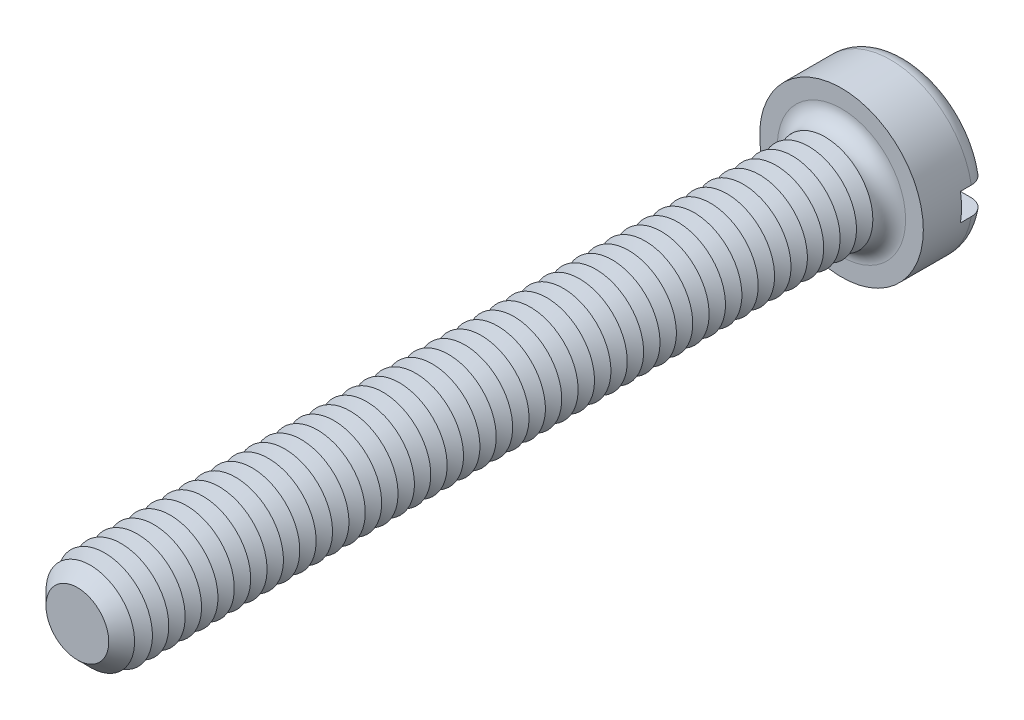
ISO-10303-21;
HEADER;
FILE_DESCRIPTION(('STEP AP214'),'2;1');
FILE_NAME('part.step','',(''),(''),'','','');
FILE_SCHEMA(('AUTOMOTIVE_DESIGN { 1 0 10303 214 1 1 1 1 }'));
ENDSEC;
DATA;
#1=APPLICATION_CONTEXT('core data for automotive mechanical design processes');
#2=APPLICATION_PROTOCOL_DEFINITION('international standard','automotive_design',2000,#1);
#3=PRODUCT_CONTEXT('',#1,'mechanical');
#4=PRODUCT('Part','Part','',(#3));
#5=PRODUCT_RELATED_PRODUCT_CATEGORY('part','',(#4));
#6=PRODUCT_DEFINITION_FORMATION('','',#4);
#7=PRODUCT_DEFINITION_CONTEXT('part definition',#1,'design');
#8=PRODUCT_DEFINITION('design','',#6,#7);
#9=PRODUCT_DEFINITION_SHAPE('','',#8);
#10=(LENGTH_UNIT() NAMED_UNIT(*) SI_UNIT(.MILLI.,.METRE.));
#11=(NAMED_UNIT(*) PLANE_ANGLE_UNIT() SI_UNIT($,.RADIAN.));
#12=(NAMED_UNIT(*) SI_UNIT($,.STERADIAN.) SOLID_ANGLE_UNIT());
#13=UNCERTAINTY_MEASURE_WITH_UNIT(LENGTH_MEASURE(1.E-05),#10,'distance_accuracy_value','');
#14=(GEOMETRIC_REPRESENTATION_CONTEXT(3) GLOBAL_UNCERTAINTY_ASSIGNED_CONTEXT((#13)) GLOBAL_UNIT_ASSIGNED_CONTEXT((#10,
#11,#12)) REPRESENTATION_CONTEXT('',''));
#15=CARTESIAN_POINT('',(0.,0.,0.));
#16=DIRECTION('',(0.,0.,1.));
#17=DIRECTION('',(1.,0.,0.));
#18=AXIS2_PLACEMENT_3D('',#15,#16,#17);
#19=CARTESIAN_POINT('',(0.,0.,-2.4));
#20=DIRECTION('',(0.,0.,1.));
#21=DIRECTION('',(1.,0.,0.));
#22=AXIS2_PLACEMENT_3D('',#19,#20,#21);
#23=PLANE('',#22);
#24=CARTESIAN_POINT('',(0.,0.,-2.4));
#25=DIRECTION('',(0.,0.,1.));
#26=DIRECTION('',(1.,0.,0.));
#27=AXIS2_PLACEMENT_3D('',#24,#25,#26);
#28=CIRCLE('',#27,2.4);
#29=CARTESIAN_POINT('',(-2.3473389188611,0.5,-2.4));
#30=VERTEX_POINT('',#29);
#31=CARTESIAN_POINT('',(2.3473389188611,0.5,-2.4));
#32=VERTEX_POINT('',#31);
#33=EDGE_CURVE('E116',#30,#32,#28,.F.);
#34=ORIENTED_EDGE('',*,*,#33,.T.);
#35=DIRECTION('',(1.,0.,0.));
#36=VECTOR('',#35,1.);
#37=CARTESIAN_POINT('',(-3.,0.5,-2.4));
#38=LINE('',#37,#36);
#39=EDGE_CURVE('E111',#30,#32,#38,.T.);
#40=ORIENTED_EDGE('',*,*,#39,.F.);
#41=EDGE_LOOP('',(#34,#40));
#42=FACE_BOUND('',#41,.T.);
#43=ADVANCED_FACE('F39',(#42),#23,.F.);
#44=CARTESIAN_POINT('',(0.,0.,-1.8));
#45=DIRECTION('',(0.,0.,1.));
#46=DIRECTION('',(1.,0.,0.));
#47=AXIS2_PLACEMENT_3D('',#44,#45,#46);
#48=TOROIDAL_SURFACE('',#47,2.4,0.6);
#49=CARTESIAN_POINT('',(-2.85761641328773,0.5,-2.13010535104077));
#50=CARTESIAN_POINT('',(-2.83871556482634,0.5,-2.1583605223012));
#51=CARTESIAN_POINT('',(-2.81738546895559,0.5,-2.18502342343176));
#52=CARTESIAN_POINT('',(-2.7705148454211,0.5,-2.23439244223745));
#53=CARTESIAN_POINT('',(-2.74496859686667,0.5,-2.25709309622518));
#54=CARTESIAN_POINT('',(-2.6904684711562,0.5,-2.29787524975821));
#55=CARTESIAN_POINT('',(-2.66151863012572,0.5,-2.3159621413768));
#56=CARTESIAN_POINT('',(-2.60103287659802,0.5,-2.34708203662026));
#57=CARTESIAN_POINT('',(-2.56949759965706,0.5,-2.36011627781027));
#58=CARTESIAN_POINT('',(-2.50430694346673,0.5,-2.38095952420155));
#59=CARTESIAN_POINT('',(-2.47062984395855,0.5,-2.38870056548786));
#60=CARTESIAN_POINT('',(-2.40245905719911,0.5,-2.39852415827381));
#61=CARTESIAN_POINT('',(-2.36796525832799,0.5,-2.40060593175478));
#62=CARTESIAN_POINT('',(-2.29850850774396,0.5,-2.39907718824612));
#63=CARTESIAN_POINT('',(-2.2635477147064,0.5,-2.3953679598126));
#64=CARTESIAN_POINT('',(-2.19472542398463,0.5,-2.38219781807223));
#65=CARTESIAN_POINT('',(-2.16086402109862,0.5,-2.37273641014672));
#66=CARTESIAN_POINT('',(-2.09483473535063,0.5,-2.3481926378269));
#67=CARTESIAN_POINT('',(-2.06268841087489,0.5,-2.3330521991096));
#68=CARTESIAN_POINT('',(-2.00140871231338,0.5,-2.29756210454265));
#69=CARTESIAN_POINT('',(-1.97227539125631,0.5,-2.27721235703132));
#70=CARTESIAN_POINT('',(-1.91805676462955,0.5,-2.23196210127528));
#71=CARTESIAN_POINT('',(-1.89294995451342,0.5,-2.20708739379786));
#72=CARTESIAN_POINT('',(-1.84740424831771,0.5,-2.1533758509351));
#73=CARTESIAN_POINT('',(-1.82696468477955,0.5,-2.12453958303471));
#74=CARTESIAN_POINT('',(-1.7919439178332,0.5,-2.06452274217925));
#75=CARTESIAN_POINT('',(-1.7772221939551,0.5,-2.03342424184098));
#76=CARTESIAN_POINT('',(-1.75343025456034,0.5,-1.96913621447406));
#77=CARTESIAN_POINT('',(-1.74435859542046,0.5,-1.93594722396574));
#78=CARTESIAN_POINT('',(-1.73243855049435,0.5,-1.86969199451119));
#79=CARTESIAN_POINT('',(-1.72938008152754,0.5,-1.83666346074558));
#80=CARTESIAN_POINT('',(-1.72896592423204,0.5,-1.77057287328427));
#81=CARTESIAN_POINT('',(-1.73160950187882,0.5,-1.73751082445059));
#82=CARTESIAN_POINT('',(-1.7423966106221,0.5,-1.67291835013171));
#83=CARTESIAN_POINT('',(-1.75043952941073,0.5,-1.64137102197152));
#84=CARTESIAN_POINT('',(-1.77163396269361,0.5,-1.58004446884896));
#85=CARTESIAN_POINT('',(-1.78478577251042,0.5,-1.55026534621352));
#86=CARTESIAN_POINT('',(-1.81598186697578,0.5,-1.49283859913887));
#87=CARTESIAN_POINT('',(-1.83409369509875,0.5,-1.46522772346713));
#88=CARTESIAN_POINT('',(-1.87455179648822,0.5,-1.41330756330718));
#89=CARTESIAN_POINT('',(-1.89689874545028,0.5,-1.38899880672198));
#90=CARTESIAN_POINT('',(-1.94600584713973,0.5,-1.34349499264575));
#91=CARTESIAN_POINT('',(-1.97289034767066,0.5,-1.32243411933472));
#92=CARTESIAN_POINT('',(-2.02972905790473,0.5,-1.28496935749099));
#93=CARTESIAN_POINT('',(-2.05968375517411,0.5,-1.26856621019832));
#94=CARTESIAN_POINT('',(-2.12276894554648,0.5,-1.24040709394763));
#95=CARTESIAN_POINT('',(-2.15596700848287,0.5,-1.22880230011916));
#96=CARTESIAN_POINT('',(-2.22383000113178,0.5,-1.21126311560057));
#97=CARTESIAN_POINT('',(-2.25849504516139,0.5,-1.20532916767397));
#98=CARTESIAN_POINT('',(-2.32870403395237,0.5,-1.1992792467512));
#99=CARTESIAN_POINT('',(-2.36425340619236,0.5,-1.19922586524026));
#100=CARTESIAN_POINT('',(-2.4348506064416,0.5,-1.2051326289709));
#101=CARTESIAN_POINT('',(-2.4698984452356,0.5,-1.21109264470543));
#102=CARTESIAN_POINT('',(-2.53821803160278,0.5,-1.22883658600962));
#103=CARTESIAN_POINT('',(-2.57150081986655,0.5,-1.24057794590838));
#104=CARTESIAN_POINT('',(-2.63557260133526,0.5,-1.2695744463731));
#105=CARTESIAN_POINT('',(-2.66636179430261,0.5,-1.28682914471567));
#106=CARTESIAN_POINT('',(-2.72402406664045,0.5,-1.32606063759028));
#107=CARTESIAN_POINT('',(-2.75095352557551,0.5,-1.34795455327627));
#108=CARTESIAN_POINT('',(-2.80067182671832,0.5,-1.39602603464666));
#109=CARTESIAN_POINT('',(-2.82346106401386,0.5,-1.42220319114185));
#110=CARTESIAN_POINT('',(-2.86383281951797,0.5,-1.47760238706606));
#111=CARTESIAN_POINT('',(-2.88149947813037,0.5,-1.50676312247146));
#112=CARTESIAN_POINT('',(-2.91160874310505,0.5,-1.56766595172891));
#113=CARTESIAN_POINT('',(-2.92405198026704,0.5,-1.59940773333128));
#114=CARTESIAN_POINT('',(-2.94319943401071,0.5,-1.66411282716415));
#115=CARTESIAN_POINT('',(-2.94997843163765,0.5,-1.69705402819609));
#116=CARTESIAN_POINT('',(-2.95787009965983,0.5,-1.7636173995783));
#117=CARTESIAN_POINT('',(-2.95898157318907,0.5,-1.79723971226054));
#118=CARTESIAN_POINT('',(-2.95551354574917,0.5,-1.86397776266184));
#119=CARTESIAN_POINT('',(-2.95096897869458,0.5,-1.89709534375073));
#120=CARTESIAN_POINT('',(-2.93638731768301,0.5,-1.96206785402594));
#121=CARTESIAN_POINT('',(-2.92635713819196,0.5,-1.99392431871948));
#122=CARTESIAN_POINT('',(-2.90618743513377,0.5,-2.04315073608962));
#123=CARTESIAN_POINT('',(-2.89769874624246,0.5,-2.06121519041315));
#124=CARTESIAN_POINT('',(-2.87895753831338,0.5,-2.096404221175));
#125=CARTESIAN_POINT('',(-2.86870503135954,0.5,-2.11352880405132));
#126=CARTESIAN_POINT('',(-2.85761641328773,0.5,-2.13010535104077));
#127=B_SPLINE_CURVE_WITH_KNOTS('',3,(#49,#50,#51,#52,#53,#54,#55,#56,#57,#58,#59,#60,#61,#62,
#63,#64,#65,#66,#67,#68,#69,#70,#71,#72,#73,#74,#75,#76,#77,#78,#79,#80,#81,#82,#83,#84,#85,#86,
#87,#88,#89,#90,#91,#92,#93,#94,#95,#96,#97,#98,#99,#100,#101,#102,#103,#104,#105,#106,#107,
#108,#109,#110,#111,#112,#113,#114,#115,#116,#117,#118,#119,#120,#121,#122,#123,#124,#125,#126),
.UNSPECIFIED.,.T.,.F.,(4,2,2,2,2,2,2,2,2,2,2,2,2,2,2,2,2,2,2,2,2,2,2,2,2,2,2,2,2,2,2,2,2,2,2,2,
2,2,4),(0.,0.101907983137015,0.203955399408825,0.305883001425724,0.407785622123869,
0.510973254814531,0.614175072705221,0.719155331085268,0.824144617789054,0.930238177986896,
1.03633360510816,1.14184204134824,1.24733537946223,1.35004136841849,1.45272110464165,
1.5517448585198,1.65075586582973,1.74797128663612,1.84519232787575,1.9438094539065,
2.0424423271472,2.14443321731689,2.24644032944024,2.35145317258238,2.45647421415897,
2.56261297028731,2.66874944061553,2.77411589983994,2.87947390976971,2.98308820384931,
3.08669260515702,3.18848388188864,3.29026286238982,3.39067588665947,3.49111011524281,
3.59092708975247,3.69061853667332,3.75040561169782,3.81019227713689),.UNSPECIFIED.);
#128=CARTESIAN_POINT('',(-2.95803989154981,0.5,-1.8));
#129=VERTEX_POINT('',#128);
#130=EDGE_CURVE('E545',#129,#30,#127,.T.);
#131=ORIENTED_EDGE('',*,*,#130,.F.);
#132=CARTESIAN_POINT('',(0.,0.,-1.8));
#133=DIRECTION('',(0.,0.,1.));
#134=DIRECTION('',(1.,0.,0.));
#135=AXIS2_PLACEMENT_3D('',#132,#133,#134);
#136=CIRCLE('',#135,3.);
#137=CARTESIAN_POINT('',(2.95803989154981,0.5,-1.8));
#138=VERTEX_POINT('',#137);
#139=EDGE_CURVE('E125',#138,#129,#136,.T.);
#140=ORIENTED_EDGE('',*,*,#139,.F.);
#141=CARTESIAN_POINT('',(1.78664846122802,0.5,-2.05158390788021));
#142=CARTESIAN_POINT('',(1.80142751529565,0.5,-2.08239430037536));
#143=CARTESIAN_POINT('',(1.81889355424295,0.5,-2.111949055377));
#144=CARTESIAN_POINT('',(1.8585933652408,0.5,-2.16770384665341));
#145=CARTESIAN_POINT('',(1.88083491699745,0.5,-2.19389829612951));
#146=CARTESIAN_POINT('',(1.92931942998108,0.5,-2.24217519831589));
#147=CARTESIAN_POINT('',(1.95555471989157,0.5,-2.26426535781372));
#148=CARTESIAN_POINT('',(2.01127789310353,0.5,-2.30384045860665));
#149=CARTESIAN_POINT('',(2.04076488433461,0.5,-2.32132665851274));
#150=CARTESIAN_POINT('',(2.10290022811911,0.5,-2.3516259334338));
#151=CARTESIAN_POINT('',(2.13560600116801,0.5,-2.3643213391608));
#152=CARTESIAN_POINT('',(2.20267136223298,0.5,-2.38412242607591));
#153=CARTESIAN_POINT('',(2.23703118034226,0.5,-2.3912273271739));
#154=CARTESIAN_POINT('',(2.30690186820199,0.5,-2.39969404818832));
#155=CARTESIAN_POINT('',(2.34242185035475,0.5,-2.40098100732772));
#156=CARTESIAN_POINT('',(2.41317063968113,0.5,-2.39753827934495));
#157=CARTESIAN_POINT('',(2.44839945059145,0.5,-2.39280866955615));
#158=CARTESIAN_POINT('',(2.51734146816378,0.5,-2.37746773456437));
#159=CARTESIAN_POINT('',(2.55106223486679,0.5,-2.3668904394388));
#160=CARTESIAN_POINT('',(2.61620389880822,0.5,-2.34013333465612));
#161=CARTESIAN_POINT('',(2.64762498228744,0.5,-2.32395397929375));
#162=CARTESIAN_POINT('',(2.70673284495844,0.5,-2.28672393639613));
#163=CARTESIAN_POINT('',(2.73447138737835,0.5,-2.26575544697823));
#164=CARTESIAN_POINT('',(2.78595339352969,0.5,-2.21938197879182));
#165=CARTESIAN_POINT('',(2.80969724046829,0.5,-2.19397742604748));
#166=CARTESIAN_POINT('',(2.85207235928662,0.5,-2.13993965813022));
#167=CARTESIAN_POINT('',(2.87078674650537,0.5,-2.11137160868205));
#168=CARTESIAN_POINT('',(2.90307455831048,0.5,-2.05146448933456));
#169=CARTESIAN_POINT('',(2.91664841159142,0.5,-2.02012565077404));
#170=CARTESIAN_POINT('',(2.93808283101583,0.5,-1.95603682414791));
#171=CARTESIAN_POINT('',(2.94602016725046,0.5,-1.92331249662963));
#172=CARTESIAN_POINT('',(2.95624273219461,0.5,-1.85699296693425));
#173=CARTESIAN_POINT('',(2.95852824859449,0.5,-1.82339780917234));
#174=CARTESIAN_POINT('',(2.95738171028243,0.5,-1.75655451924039));
#175=CARTESIAN_POINT('',(2.95399174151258,0.5,-1.72330565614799));
#176=CARTESIAN_POINT('',(2.94167749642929,0.5,-1.65784996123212));
#177=CARTESIAN_POINT('',(2.93275329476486,0.5,-1.62564311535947));
#178=CARTESIAN_POINT('',(2.90963870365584,0.5,-1.56317641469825));
#179=CARTESIAN_POINT('',(2.89544787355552,0.5,-1.53291672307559));
#180=CARTESIAN_POINT('',(2.86222325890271,0.5,-1.47518589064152));
#181=CARTESIAN_POINT('',(2.84318935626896,0.5,-1.44771481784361));
#182=CARTESIAN_POINT('',(2.80067851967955,0.5,-1.39611362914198));
#183=CARTESIAN_POINT('',(2.77716960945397,0.5,-1.37200986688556));
#184=CARTESIAN_POINT('',(2.72648704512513,0.5,-1.3280274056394));
#185=CARTESIAN_POINT('',(2.69931317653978,0.5,-1.3081489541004));
#186=CARTESIAN_POINT('',(2.64167967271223,0.5,-1.27288334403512));
#187=CARTESIAN_POINT('',(2.61118015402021,0.5,-1.25756138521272));
#188=CARTESIAN_POINT('',(2.54807315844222,0.5,-1.2321564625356));
#189=CARTESIAN_POINT('',(2.51546550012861,0.5,-1.22207395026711));
#190=CARTESIAN_POINT('',(2.44846246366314,0.5,-1.20724783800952));
#191=CARTESIAN_POINT('',(2.41404584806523,0.5,-1.2026002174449));
#192=CARTESIAN_POINT('',(2.34491756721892,0.5,-1.19904907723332));
#193=CARTESIAN_POINT('',(2.3102058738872,0.5,-1.20014611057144));
#194=CARTESIAN_POINT('',(2.24087507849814,0.5,-1.20808958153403));
#195=CARTESIAN_POINT('',(2.20626660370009,0.5,-1.21502895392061));
#196=CARTESIAN_POINT('',(2.13868705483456,0.5,-1.23457616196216));
#197=CARTESIAN_POINT('',(2.10571611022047,0.5,-1.24718444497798));
#198=CARTESIAN_POINT('',(2.04212010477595,0.5,-1.2778419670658));
#199=CARTESIAN_POINT('',(2.0115131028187,0.5,-1.29592871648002));
#200=CARTESIAN_POINT('',(1.95381117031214,0.5,-1.33703838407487));
#201=CARTESIAN_POINT('',(1.92671618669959,0.5,-1.36006122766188));
#202=CARTESIAN_POINT('',(1.8771749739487,0.5,-1.41014760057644));
#203=CARTESIAN_POINT('',(1.85467966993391,0.5,-1.43716252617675));
#204=CARTESIAN_POINT('',(1.8147167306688,0.5,-1.49468601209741));
#205=CARTESIAN_POINT('',(1.79724791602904,0.5,-1.52519375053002));
#206=CARTESIAN_POINT('',(1.76843420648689,0.5,-1.58782676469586));
#207=CARTESIAN_POINT('',(1.75691546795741,0.5,-1.61987202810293));
#208=CARTESIAN_POINT('',(1.73963101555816,0.5,-1.68548715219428));
#209=CARTESIAN_POINT('',(1.73386545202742,0.5,-1.71905705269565));
#210=CARTESIAN_POINT('',(1.72840927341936,0.5,-1.78556262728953));
#211=CARTESIAN_POINT('',(1.72852416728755,0.5,-1.8184825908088));
#212=CARTESIAN_POINT('',(1.73434422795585,0.5,-1.88379362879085));
#213=CARTESIAN_POINT('',(1.74004181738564,0.5,-1.91618535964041));
#214=CARTESIAN_POINT('',(1.75312909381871,0.5,-1.96568884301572));
#215=CARTESIAN_POINT('',(1.75869685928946,0.5,-1.98330302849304));
#216=CARTESIAN_POINT('',(1.77146455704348,0.5,-2.01792824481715));
#217=CARTESIAN_POINT('',(1.7786644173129,0.5,-2.03493930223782));
#218=CARTESIAN_POINT('',(1.78664846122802,0.5,-2.05158390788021));
#219=B_SPLINE_CURVE_WITH_KNOTS('',3,(#141,#142,#143,#144,#145,#146,#147,#148,#149,#150,#151,
#152,#153,#154,#155,#156,#157,#158,#159,#160,#161,#162,#163,#164,#165,#166,#167,#168,#169,#170,
#171,#172,#173,#174,#175,#176,#177,#178,#179,#180,#181,#182,#183,#184,#185,#186,#187,#188,#189,
#190,#191,#192,#193,#194,#195,#196,#197,#198,#199,#200,#201,#202,#203,#204,#205,#206,#207,#208,
#209,#210,#211,#212,#213,#214,#215,#216,#217,#218),.UNSPECIFIED.,.T.,.F.,(4,2,2,2,2,2,2,2,2,2,2,
2,2,2,2,2,2,2,2,2,2,2,2,2,2,2,2,2,2,2,2,2,2,2,2,2,2,2,4),(0.,0.10244464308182,0.205057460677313,
0.307475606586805,0.409865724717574,0.514628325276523,0.619405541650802,0.72552718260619,
0.831647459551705,0.937156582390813,1.04265715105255,1.1464674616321,1.25026780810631,
1.3522293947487,1.45418247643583,1.55471883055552,1.6552500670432,1.75503912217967,
1.8548268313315,1.95462289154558,2.05442138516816,2.15496174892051,2.25550799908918,
2.35743049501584,2.45936177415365,2.56306719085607,2.66678259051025,2.77217967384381,
2.87758507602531,2.98372914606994,3.08987161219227,3.19481457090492,3.29973288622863,
3.40138228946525,3.50303434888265,3.60132659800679,3.69948562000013,3.75483142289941,
3.8101747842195),.UNSPECIFIED.);
#220=EDGE_CURVE('E547',#32,#138,#219,.T.);
#221=ORIENTED_EDGE('',*,*,#220,.F.);
#222=ORIENTED_EDGE('',*,*,#33,.F.);
#223=EDGE_LOOP('',(#131,#140,#221,#222));
#224=FACE_BOUND('',#223,.T.);
#225=ADVANCED_FACE('F529',(#224),#48,.T.);
#226=CARTESIAN_POINT('',(0.,0.,-2.4));
#227=DIRECTION('',(0.,0.,1.));
#228=DIRECTION('',(1.,0.,0.));
#229=AXIS2_PLACEMENT_3D('',#226,#227,#228);
#230=CYLINDRICAL_SURFACE('',#229,3.);
#231=DIRECTION('',(0.,0.,1.));
#232=VECTOR('',#231,1.);
#233=CARTESIAN_POINT('',(2.95803989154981,0.5,-2.4));
#234=LINE('',#233,#232);
#235=CARTESIAN_POINT('',(2.95803989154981,0.5,-1.4));
#236=VERTEX_POINT('',#235);
#237=EDGE_CURVE('E563',#138,#236,#234,.T.);
#238=ORIENTED_EDGE('',*,*,#237,.F.);
#239=ORIENTED_EDGE('',*,*,#139,.T.);
#240=DIRECTION('',(0.,0.,1.));
#241=VECTOR('',#240,1.);
#242=CARTESIAN_POINT('',(-2.95803989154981,0.5,-2.4));
#243=LINE('',#242,#241);
#244=CARTESIAN_POINT('',(-2.95803989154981,0.5,-1.4));
#245=VERTEX_POINT('',#244);
#246=EDGE_CURVE('E63',#245,#129,#243,.F.);
#247=ORIENTED_EDGE('',*,*,#246,.F.);
#248=CARTESIAN_POINT('',(0.,0.,-1.4));
#249=DIRECTION('',(0.,0.,-1.));
#250=DIRECTION('',(-1.,0.,0.));
#251=AXIS2_PLACEMENT_3D('',#248,#249,#250);
#252=CIRCLE('',#251,3.);
#253=CARTESIAN_POINT('',(-2.95803989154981,-0.5,-1.4));
#254=VERTEX_POINT('',#253);
#255=EDGE_CURVE('E43',#245,#254,#252,.F.);
#256=ORIENTED_EDGE('',*,*,#255,.T.);
#257=DIRECTION('',(0.,0.,1.));
#258=VECTOR('',#257,1.);
#259=CARTESIAN_POINT('',(-2.95803989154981,-0.5,-2.4));
#260=LINE('',#259,#258);
#261=CARTESIAN_POINT('',(-2.9580398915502,-0.5,-1.79999999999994));
#262=VERTEX_POINT('',#261);
#263=EDGE_CURVE('E560',#262,#254,#260,.T.);
#264=ORIENTED_EDGE('',*,*,#263,.F.);
#265=CARTESIAN_POINT('',(2.95803989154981,-0.5,-1.8));
#266=VERTEX_POINT('',#265);
#267=EDGE_CURVE('E127',#262,#266,#136,.T.);
#268=ORIENTED_EDGE('',*,*,#267,.T.);
#269=DIRECTION('',(0.,0.,1.));
#270=VECTOR('',#269,1.);
#271=CARTESIAN_POINT('',(2.95803989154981,-0.5,-2.4));
#272=LINE('',#271,#270);
#273=CARTESIAN_POINT('',(2.95803989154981,-0.5,-1.4));
#274=VERTEX_POINT('',#273);
#275=EDGE_CURVE('E55',#274,#266,#272,.F.);
#276=ORIENTED_EDGE('',*,*,#275,.F.);
#277=EDGE_CURVE('E11',#274,#236,#252,.F.);
#278=ORIENTED_EDGE('',*,*,#277,.T.);
#279=EDGE_LOOP('',(#238,#239,#247,#256,#264,#268,#276,#278));
#280=FACE_BOUND('',#279,.T.);
#281=CARTESIAN_POINT('',(0.,0.,0.));
#282=DIRECTION('',(0.,0.,1.));
#283=DIRECTION('',(1.,0.,0.));
#284=AXIS2_PLACEMENT_3D('',#281,#282,#283);
#285=CIRCLE('',#284,3.);
#286=CARTESIAN_POINT('',(3.,0.,0.));
#287=VERTEX_POINT('',#286);
#288=EDGE_CURVE('E566',#287,#287,#285,.T.);
#289=ORIENTED_EDGE('',*,*,#288,.F.);
#290=EDGE_LOOP('',(#289));
#291=FACE_BOUND('',#290,.T.);
#292=ADVANCED_FACE('F525',(#280,#291),#230,.T.);
#293=CARTESIAN_POINT('',(2.3473389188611,-0.5,-2.4));
#294=VERTEX_POINT('',#293);
#295=CARTESIAN_POINT('',(-2.3473389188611,-0.5,-2.4));
#296=VERTEX_POINT('',#295);
#297=EDGE_CURVE('E109',#294,#296,#28,.F.);
#298=ORIENTED_EDGE('',*,*,#297,.T.);
#299=DIRECTION('',(-1.,0.,0.));
#300=VECTOR('',#299,1.);
#301=CARTESIAN_POINT('',(-3.,-0.5,-2.4));
#302=LINE('',#301,#300);
#303=EDGE_CURVE('E96',#294,#296,#302,.T.);
#304=ORIENTED_EDGE('',*,*,#303,.F.);
#305=EDGE_LOOP('',(#298,#304));
#306=FACE_BOUND('',#305,.T.);
#307=ADVANCED_FACE('F108',(#306),#23,.F.);
#308=CARTESIAN_POINT('',(0.,0.,0.));
#309=DIRECTION('',(0.,0.,1.));
#310=DIRECTION('',(1.,0.,0.));
#311=AXIS2_PLACEMENT_3D('',#308,#309,#310);
#312=PLANE('',#311);
#313=CARTESIAN_POINT('',(0.,0.,0.));
#314=DIRECTION('',(0.,0.,1.));
#315=DIRECTION('',(1.,0.,0.));
#316=AXIS2_PLACEMENT_3D('',#313,#314,#315);
#317=CIRCLE('',#316,2.35);
#318=CARTESIAN_POINT('',(2.35,0.,0.));
#319=VERTEX_POINT('',#318);
#320=EDGE_CURVE('E115',#319,#319,#317,.F.);
#321=ORIENTED_EDGE('',*,*,#320,.T.);
#322=EDGE_LOOP('',(#321));
#323=FACE_BOUND('',#322,.T.);
#324=ORIENTED_EDGE('',*,*,#288,.T.);
#325=EDGE_LOOP('',(#324));
#326=FACE_BOUND('',#325,.T.);
#327=ADVANCED_FACE('F524',(#323,#326),#312,.T.);
#328=CARTESIAN_POINT('',(-2.85761641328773,-0.5,-2.13010535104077));
#329=CARTESIAN_POINT('',(-2.87617085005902,-0.5,-2.10236255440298));
#330=CARTESIAN_POINT('',(-2.89241094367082,-0.5,-2.07304478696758));
#331=CARTESIAN_POINT('',(-2.91975805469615,-0.5,-2.01207835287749));
#332=CARTESIAN_POINT('',(-2.93085958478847,-0.5,-1.98042723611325));
#333=CARTESIAN_POINT('',(-2.94757590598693,-0.5,-1.91570997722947));
#334=CARTESIAN_POINT('',(-2.95319165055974,-0.5,-1.88264408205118));
#335=CARTESIAN_POINT('',(-2.95876526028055,-0.5,-1.81604673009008));
#336=CARTESIAN_POINT('',(-2.95872441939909,-0.5,-1.78251538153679));
#337=CARTESIAN_POINT('',(-2.95300126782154,-0.5,-1.71606888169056));
#338=CARTESIAN_POINT('',(-2.94734076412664,-0.5,-1.68315184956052));
#339=CARTESIAN_POINT('',(-2.93058183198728,-0.5,-1.61873244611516));
#340=CARTESIAN_POINT('',(-2.91948325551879,-0.5,-1.58723011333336));
#341=CARTESIAN_POINT('',(-2.89215903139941,-0.5,-1.52647404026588));
#342=CARTESIAN_POINT('',(-2.87592518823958,-0.5,-1.49722398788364));
#343=CARTESIAN_POINT('',(-2.83881787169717,-0.5,-1.44183365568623));
#344=CARTESIAN_POINT('',(-2.81794425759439,-0.5,-1.41569347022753));
#345=CARTESIAN_POINT('',(-2.77196258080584,-0.5,-1.36700890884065));
#346=CARTESIAN_POINT('',(-2.74681874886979,-0.5,-1.34449832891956));
#347=CARTESIAN_POINT('',(-2.69315595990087,-0.5,-1.30394571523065));
#348=CARTESIAN_POINT('',(-2.66463678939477,-0.5,-1.28590396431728));
#349=CARTESIAN_POINT('',(-2.6045885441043,-0.5,-1.25451133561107));
#350=CARTESIAN_POINT('',(-2.573021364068,-0.5,-1.24123336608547));
#351=CARTESIAN_POINT('',(-2.50813094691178,-0.5,-1.22006271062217));
#352=CARTESIAN_POINT('',(-2.47480755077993,-0.5,-1.21217051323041));
#353=CARTESIAN_POINT('',(-2.40672281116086,-0.5,-1.20185046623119));
#354=CARTESIAN_POINT('',(-2.37194646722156,-0.5,-1.19952155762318));
#355=CARTESIAN_POINT('',(-2.30248663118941,-0.5,-1.20064178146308));
#356=CARTESIAN_POINT('',(-2.26780314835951,-0.5,-1.20409147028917));
#357=CARTESIAN_POINT('',(-2.19896003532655,-0.5,-1.21674803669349));
#358=CARTESIAN_POINT('',(-2.16481620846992,-0.5,-1.22604100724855));
#359=CARTESIAN_POINT('',(-2.09855902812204,-0.5,-1.25020237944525));
#360=CARTESIAN_POINT('',(-2.0664458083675,-0.5,-1.2650711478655));
#361=CARTESIAN_POINT('',(-2.00504979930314,-0.5,-1.3000633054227));
#362=CARTESIAN_POINT('',(-1.97577870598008,-0.5,-1.32020724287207));
#363=CARTESIAN_POINT('',(-1.92109882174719,-0.5,-1.36519538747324));
#364=CARTESIAN_POINT('',(-1.89568984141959,-0.5,-1.39003936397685));
#365=CARTESIAN_POINT('',(-1.84992350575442,-0.5,-1.44333696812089));
#366=CARTESIAN_POINT('',(-1.82949305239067,-0.5,-1.47172774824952));
#367=CARTESIAN_POINT('',(-1.79388305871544,-0.5,-1.53163225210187));
#368=CARTESIAN_POINT('',(-1.77870235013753,-0.5,-1.56314527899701));
#369=CARTESIAN_POINT('',(-1.7545759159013,-0.5,-1.62726698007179));
#370=CARTESIAN_POINT('',(-1.74543784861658,-0.5,-1.65980327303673));
#371=CARTESIAN_POINT('',(-1.73294830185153,-0.5,-1.72596654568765));
#372=CARTESIAN_POINT('',(-1.72959555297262,-0.5,-1.7595932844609));
#373=CARTESIAN_POINT('',(-1.72881879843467,-0.5,-1.82588200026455));
#374=CARTESIAN_POINT('',(-1.73121660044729,-0.5,-1.85854202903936));
#375=CARTESIAN_POINT('',(-1.74148022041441,-0.5,-1.9229888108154));
#376=CARTESIAN_POINT('',(-1.74934586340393,-0.5,-1.95477559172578));
#377=CARTESIAN_POINT('',(-1.77023164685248,-0.5,-2.01650910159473));
#378=CARTESIAN_POINT('',(-1.78323812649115,-0.5,-2.04646046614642));
#379=CARTESIAN_POINT('',(-1.81396733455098,-0.5,-2.10383471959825));
#380=CARTESIAN_POINT('',(-1.83169061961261,-0.5,-2.13125730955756));
#381=CARTESIAN_POINT('',(-1.87183626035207,-0.5,-2.18359240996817));
#382=CARTESIAN_POINT('',(-1.89437158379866,-0.5,-2.20841820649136));
#383=CARTESIAN_POINT('',(-1.9431646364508,-0.5,-2.25409214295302));
#384=CARTESIAN_POINT('',(-1.96942301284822,-0.5,-2.27493958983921));
#385=CARTESIAN_POINT('',(-2.025898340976,-0.5,-2.31281042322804));
#386=CARTESIAN_POINT('',(-2.05622082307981,-0.5,-2.32967654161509));
#387=CARTESIAN_POINT('',(-2.11922391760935,-0.5,-2.35820255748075));
#388=CARTESIAN_POINT('',(-2.15190483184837,-0.5,-2.3698617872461));
#389=CARTESIAN_POINT('',(-2.21944675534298,-0.5,-2.38785911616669));
#390=CARTESIAN_POINT('',(-2.25433929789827,-0.5,-2.39407914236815));
#391=CARTESIAN_POINT('',(-2.32467357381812,-0.5,-2.40058243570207));
#392=CARTESIAN_POINT('',(-2.36011530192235,-0.5,-2.40086575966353));
#393=CARTESIAN_POINT('',(-2.43058129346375,-0.5,-2.39545061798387));
#394=CARTESIAN_POINT('',(-2.46560504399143,-0.5,-2.38974544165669));
#395=CARTESIAN_POINT('',(-2.53418188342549,-0.5,-2.37245602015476));
#396=CARTESIAN_POINT('',(-2.56773468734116,-0.5,-2.36087064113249));
#397=CARTESIAN_POINT('',(-2.63195003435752,-0.5,-2.33229154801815));
#398=CARTESIAN_POINT('',(-2.66264330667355,-0.5,-2.31536681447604));
#399=CARTESIAN_POINT('',(-2.72065333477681,-0.5,-2.2765252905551));
#400=CARTESIAN_POINT('',(-2.7479744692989,-0.5,-2.25461508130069));
#401=CARTESIAN_POINT('',(-2.78903570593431,-0.5,-2.21539504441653));
#402=CARTESIAN_POINT('',(-2.80405150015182,-0.5,-2.19939833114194));
#403=CARTESIAN_POINT('',(-2.83224965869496,-0.5,-2.16586257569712));
#404=CARTESIAN_POINT('',(-2.84543204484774,-0.5,-2.14832355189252));
#405=CARTESIAN_POINT('',(-2.85761641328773,-0.5,-2.13010535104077));
#406=B_SPLINE_CURVE_WITH_KNOTS('',3,(#328,#329,#330,#331,#332,#333,#334,#335,#336,#337,#338,
#339,#340,#341,#342,#343,#344,#345,#346,#347,#348,#349,#350,#351,#352,#353,#354,#355,#356,#357,
#358,#359,#360,#361,#362,#363,#364,#365,#366,#367,#368,#369,#370,#371,#372,#373,#374,#375,#376,
#377,#378,#379,#380,#381,#382,#383,#384,#385,#386,#387,#388,#389,#390,#391,#392,#393,#394,#395,
#396,#397,#398,#399,#400,#401,#402,#403,#404,#405),.UNSPECIFIED.,.T.,.F.,(4,2,2,2,2,2,2,2,2,2,2,
2,2,2,2,2,2,2,2,2,2,2,2,2,2,2,2,2,2,2,2,2,2,2,2,2,2,2,4),(0.,0.100047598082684,
0.200201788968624,0.300338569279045,0.400452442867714,0.500179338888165,0.599908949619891,
0.699798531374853,0.799691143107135,0.900465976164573,1.00124718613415,1.10351091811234,
1.20578392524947,1.30986270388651,1.41395150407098,1.51961105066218,1.62527754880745,
1.73136193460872,1.83744111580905,1.94185359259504,2.04624281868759,2.1471248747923,
2.24798479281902,2.34575994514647,2.44353196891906,2.541045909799,2.63857136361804,
2.73870431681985,2.83885469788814,2.94247024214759,3.0460990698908,3.15192527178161,
3.25775046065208,3.36369436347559,3.46965870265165,3.57430655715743,3.67881706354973,
3.74451732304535,3.81021680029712),.UNSPECIFIED.);
#407=EDGE_CURVE('E103',#296,#262,#406,.T.);
#408=ORIENTED_EDGE('',*,*,#407,.F.);
#409=ORIENTED_EDGE('',*,*,#297,.F.);
#410=CARTESIAN_POINT('',(1.78664846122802,-0.5,-2.05158390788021));
#411=CARTESIAN_POINT('',(1.77253256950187,-0.5,-2.02214917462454));
#412=CARTESIAN_POINT('',(1.76084795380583,-0.5,-1.99152692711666));
#413=CARTESIAN_POINT('',(1.74276267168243,-0.5,-1.92873811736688));
#414=CARTESIAN_POINT('',(1.73636622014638,-0.5,-1.89657034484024));
#415=CARTESIAN_POINT('',(1.72910271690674,-0.5,-1.83160458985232));
#416=CARTESIAN_POINT('',(1.72823699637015,-0.5,-1.79880645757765));
#417=CARTESIAN_POINT('',(1.73207277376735,-0.5,-1.73354460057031));
#418=CARTESIAN_POINT('',(1.7367732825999,-0.5,-1.70108081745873));
#419=CARTESIAN_POINT('',(1.75151033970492,-0.5,-1.63763571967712));
#420=CARTESIAN_POINT('',(1.76150868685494,-0.5,-1.60664550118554));
#421=CARTESIAN_POINT('',(1.78646773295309,-0.5,-1.54673433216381));
#422=CARTESIAN_POINT('',(1.80142897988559,-0.5,-1.51781361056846));
#423=CARTESIAN_POINT('',(1.8361687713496,-0.5,-1.46223275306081));
#424=CARTESIAN_POINT('',(1.85603637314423,-0.5,-1.43562834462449));
#425=CARTESIAN_POINT('',(1.89981598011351,-0.5,-1.38598822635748));
#426=CARTESIAN_POINT('',(1.92372865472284,-0.5,-1.3629531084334));
#427=CARTESIAN_POINT('',(1.97581791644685,-0.5,-1.32025912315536));
#428=CARTESIAN_POINT('',(2.00411431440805,-0.5,-1.30074638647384));
#429=CARTESIAN_POINT('',(2.06351340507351,-0.5,-1.26660223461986));
#430=CARTESIAN_POINT('',(2.09461651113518,-0.5,-1.2519715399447));
#431=CARTESIAN_POINT('',(2.15964055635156,-0.5,-1.22763649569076));
#432=CARTESIAN_POINT('',(2.19361437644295,-0.5,-1.21807321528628));
#433=CARTESIAN_POINT('',(2.26268197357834,-0.5,-1.20474094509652));
#434=CARTESIAN_POINT('',(2.29777581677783,-0.5,-1.20097229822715));
#435=CARTESIAN_POINT('',(2.36834397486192,-0.5,-1.19935270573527));
#436=CARTESIAN_POINT('',(2.40381924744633,-0.5,-1.20154258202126));
#437=CARTESIAN_POINT('',(2.47388621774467,-0.5,-1.211906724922));
#438=CARTESIAN_POINT('',(2.50847794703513,-0.5,-1.22008077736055));
#439=CARTESIAN_POINT('',(2.57542869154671,-0.5,-1.24211740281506));
#440=CARTESIAN_POINT('',(2.60780612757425,-0.5,-1.25592395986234));
#441=CARTESIAN_POINT('',(2.66972487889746,-0.5,-1.28886991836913));
#442=CARTESIAN_POINT('',(2.69926644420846,-0.5,-1.3080088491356));
#443=CARTESIAN_POINT('',(2.75412764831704,-0.5,-1.35072337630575));
#444=CARTESIAN_POINT('',(2.77951140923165,-0.5,-1.37421661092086));
#445=CARTESIAN_POINT('',(2.82588981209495,-0.5,-1.42519687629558));
#446=CARTESIAN_POINT('',(2.84688487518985,-0.5,-1.4526835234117));
#447=CARTESIAN_POINT('',(2.88351678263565,-0.5,-1.51036368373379));
#448=CARTESIAN_POINT('',(2.89923879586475,-0.5,-1.54050312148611));
#449=CARTESIAN_POINT('',(2.92532780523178,-0.5,-1.60301687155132));
#450=CARTESIAN_POINT('',(2.93569520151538,-0.5,-1.63539101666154));
#451=CARTESIAN_POINT('',(2.95066155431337,-0.5,-1.70102985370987));
#452=CARTESIAN_POINT('',(2.95532930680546,-0.5,-1.73427887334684));
#453=CARTESIAN_POINT('',(2.9589838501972,-0.5,-1.80108716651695));
#454=CARTESIAN_POINT('',(2.95797087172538,-0.5,-1.83464642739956));
#455=CARTESIAN_POINT('',(2.9503157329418,-0.5,-1.90093629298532));
#456=CARTESIAN_POINT('',(2.9437032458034,-0.5,-1.93367033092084));
#457=CARTESIAN_POINT('',(2.92508830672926,-0.5,-1.99756717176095));
#458=CARTESIAN_POINT('',(2.91308586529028,-0.5,-2.02872997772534));
#459=CARTESIAN_POINT('',(2.88401713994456,-0.5,-2.08868263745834));
#460=CARTESIAN_POINT('',(2.86693946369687,-0.5,-2.11746696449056));
#461=CARTESIAN_POINT('',(2.82823635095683,-0.5,-2.17179415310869));
#462=CARTESIAN_POINT('',(2.80661076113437,-0.5,-2.19733690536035));
#463=CARTESIAN_POINT('',(2.75921750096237,-0.5,-2.24472182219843));
#464=CARTESIAN_POINT('',(2.73341278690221,-0.5,-2.26652692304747));
#465=CARTESIAN_POINT('',(2.67855512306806,-0.5,-2.30557116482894));
#466=CARTESIAN_POINT('',(2.64950194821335,-0.5,-2.32280998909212));
#467=CARTESIAN_POINT('',(2.58850670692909,-0.5,-2.35251615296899));
#468=CARTESIAN_POINT('',(2.55652763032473,-0.5,-2.36490748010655));
#469=CARTESIAN_POINT('',(2.4909651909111,-0.5,-2.38424946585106));
#470=CARTESIAN_POINT('',(2.45738167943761,-0.5,-2.39119961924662));
#471=CARTESIAN_POINT('',(2.38892891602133,-0.5,-2.39958830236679));
#472=CARTESIAN_POINT('',(2.35404742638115,-0.5,-2.40092701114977));
#473=CARTESIAN_POINT('',(2.28454389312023,-0.5,-2.39781917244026));
#474=CARTESIAN_POINT('',(2.24992186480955,-0.5,-2.39337228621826));
#475=CARTESIAN_POINT('',(2.18139250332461,-0.5,-2.37872879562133));
#476=CARTESIAN_POINT('',(2.14750264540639,-0.5,-2.36845030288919));
#477=CARTESIAN_POINT('',(2.08190943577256,-0.5,-2.34236291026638));
#478=CARTESIAN_POINT('',(2.05020675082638,-0.5,-2.32655233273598));
#479=CARTESIAN_POINT('',(1.98982495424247,-0.5,-2.28976285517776));
#480=CARTESIAN_POINT('',(1.96115527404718,-0.5,-2.26876847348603));
#481=CARTESIAN_POINT('',(1.90785147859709,-0.5,-2.22220002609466));
#482=CARTESIAN_POINT('',(1.88321231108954,-0.5,-2.19663177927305));
#483=CARTESIAN_POINT('',(1.84638483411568,-0.5,-2.15106161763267));
#484=CARTESIAN_POINT('',(1.8328227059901,-0.5,-2.13215328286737));
#485=CARTESIAN_POINT('',(1.80797918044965,-0.5,-2.09289185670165));
#486=CARTESIAN_POINT('',(1.79669771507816,-0.5,-2.07253880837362));
#487=CARTESIAN_POINT('',(1.78664846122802,-0.5,-2.05158390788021));
#488=B_SPLINE_CURVE_WITH_KNOTS('',3,(#410,#411,#412,#413,#414,#415,#416,#417,#418,#419,#420,
#421,#422,#423,#424,#425,#426,#427,#428,#429,#430,#431,#432,#433,#434,#435,#436,#437,#438,#439,
#440,#441,#442,#443,#444,#445,#446,#447,#448,#449,#450,#451,#452,#453,#454,#455,#456,#457,#458,
#459,#460,#461,#462,#463,#464,#465,#466,#467,#468,#469,#470,#471,#472,#473,#474,#475,#476,#477,
#478,#479,#480,#481,#482,#483,#484,#485,#486,#487),.UNSPECIFIED.,.T.,.F.,(4,2,2,2,2,2,2,2,2,2,2,
2,2,2,2,2,2,2,2,2,2,2,2,2,2,2,2,2,2,2,2,2,2,2,2,2,2,2,4),(0.,0.0978512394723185,0.19578039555,
0.293733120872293,0.391668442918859,0.488907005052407,0.58615630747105,0.685320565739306,
0.784501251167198,0.887148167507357,0.989810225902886,1.09519726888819,1.20059054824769,
1.30670769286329,1.41282103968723,1.51790384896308,1.62297738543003,1.72623563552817,
1.82948397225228,1.93097382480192,2.03245609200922,2.13270093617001,2.23294171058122,
2.33265458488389,2.43236726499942,2.53230548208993,2.63224706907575,2.73312861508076,
2.83401715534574,2.93642973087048,3.03885181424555,3.14308833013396,3.24733094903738,
3.35307493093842,3.45885100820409,3.56494689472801,3.67090875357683,3.74057217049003,
3.81023351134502),.UNSPECIFIED.);
#489=EDGE_CURVE('E92',#266,#294,#488,.T.);
#490=ORIENTED_EDGE('',*,*,#489,.F.);
#491=ORIENTED_EDGE('',*,*,#267,.F.);
#492=EDGE_LOOP('',(#408,#409,#490,#491));
#493=FACE_BOUND('',#492,.T.);
#494=ADVANCED_FACE('F113',(#493),#48,.T.);
#495=CARTESIAN_POINT('',(0.,0.,0.6));
#496=DIRECTION('',(0.,0.,1.));
#497=DIRECTION('',(1.,0.,0.));
#498=AXIS2_PLACEMENT_3D('',#495,#496,#497);
#499=TOROIDAL_SURFACE('',#498,2.35,0.6);
#500=ORIENTED_EDGE('',*,*,#320,.F.);
#501=EDGE_LOOP('',(#500));
#502=FACE_BOUND('',#501,.T.);
#503=CARTESIAN_POINT('',(0.,0.,0.6));
#504=DIRECTION('',(0.,0.,-1.));
#505=DIRECTION('',(-1.,0.,0.));
#506=AXIS2_PLACEMENT_3D('',#503,#504,#505);
#507=CIRCLE('',#506,1.75);
#508=CARTESIAN_POINT('',(-1.75,0.,0.6));
#509=VERTEX_POINT('',#508);
#510=EDGE_CURVE('E571',#509,#509,#507,.T.);
#511=ORIENTED_EDGE('',*,*,#510,.T.);
#512=EDGE_LOOP('',(#511));
#513=FACE_BOUND('',#512,.T.);
#514=ADVANCED_FACE('F517',(#502,#513),#499,.F.);
#515=CARTESIAN_POINT('',(0.,0.,0.9));
#516=DIRECTION('',(0.,0.,-1.));
#517=DIRECTION('',(-1.,0.,0.));
#518=AXIS2_PLACEMENT_3D('',#515,#516,#517);
#519=CONICAL_SURFACE('',#518,1.23038475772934,1.0471975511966);
#520=ORIENTED_EDGE('',*,*,#510,.F.);
#521=EDGE_LOOP('',(#520));
#522=FACE_BOUND('',#521,.T.);
#523=CARTESIAN_POINT('',(0.,0.,0.9));
#524=DIRECTION('',(0.,0.,-1.));
#525=DIRECTION('',(-1.,0.,0.));
#526=AXIS2_PLACEMENT_3D('',#523,#524,#525);
#527=CIRCLE('',#526,1.23038475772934);
#528=CARTESIAN_POINT('',(-1.23038475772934,0.,0.9));
#529=VERTEX_POINT('',#528);
#530=EDGE_CURVE('E576',#529,#529,#527,.T.);
#531=ORIENTED_EDGE('',*,*,#530,.T.);
#532=EDGE_LOOP('',(#531));
#533=FACE_BOUND('',#532,.T.);
#534=ADVANCED_FACE('F513',(#522,#533),#519,.T.);
#535=CARTESIAN_POINT('',(0.,0.,1.2));
#536=DIRECTION('',(0.,0.,1.));
#537=DIRECTION('',(1.,0.,0.));
#538=AXIS2_PLACEMENT_3D('',#535,#536,#537);
#539=CONICAL_SURFACE('',#538,1.75,1.0471975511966);
#540=ORIENTED_EDGE('',*,*,#530,.F.);
#541=EDGE_LOOP('',(#540));
#542=FACE_BOUND('',#541,.T.);
#543=CARTESIAN_POINT('',(0.,0.,1.2));
#544=DIRECTION('',(0.,0.,-1.));
#545=DIRECTION('',(-1.,0.,0.));
#546=AXIS2_PLACEMENT_3D('',#543,#544,#545);
#547=CIRCLE('',#546,1.75);
#548=CARTESIAN_POINT('',(-1.75,0.,1.2));
#549=VERTEX_POINT('',#548);
#550=EDGE_CURVE('E582',#549,#549,#547,.T.);
#551=ORIENTED_EDGE('',*,*,#550,.T.);
#552=EDGE_LOOP('',(#551));
#553=FACE_BOUND('',#552,.T.);
#554=ADVANCED_FACE('F509',(#542,#553),#539,.T.);
#555=CARTESIAN_POINT('',(0.,0.,1.5));
#556=DIRECTION('',(0.,0.,-1.));
#557=DIRECTION('',(-1.,0.,0.));
#558=AXIS2_PLACEMENT_3D('',#555,#556,#557);
#559=CONICAL_SURFACE('',#558,1.23038475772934,1.0471975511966);
#560=ORIENTED_EDGE('',*,*,#550,.F.);
#561=EDGE_LOOP('',(#560));
#562=FACE_BOUND('',#561,.T.);
#563=CARTESIAN_POINT('',(0.,0.,1.5));
#564=DIRECTION('',(0.,0.,-1.));
#565=DIRECTION('',(-1.,0.,0.));
#566=AXIS2_PLACEMENT_3D('',#563,#564,#565);
#567=CIRCLE('',#566,1.23038475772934);
#568=CARTESIAN_POINT('',(-1.23038475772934,0.,1.5));
#569=VERTEX_POINT('',#568);
#570=EDGE_CURVE('E586',#569,#569,#567,.T.);
#571=ORIENTED_EDGE('',*,*,#570,.T.);
#572=EDGE_LOOP('',(#571));
#573=FACE_BOUND('',#572,.T.);
#574=ADVANCED_FACE('F505',(#562,#573),#559,.T.);
#575=CARTESIAN_POINT('',(0.,0.,1.8));
#576=DIRECTION('',(0.,0.,1.));
#577=DIRECTION('',(1.,0.,0.));
#578=AXIS2_PLACEMENT_3D('',#575,#576,#577);
#579=CONICAL_SURFACE('',#578,1.75,1.0471975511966);
#580=ORIENTED_EDGE('',*,*,#570,.F.);
#581=EDGE_LOOP('',(#580));
#582=FACE_BOUND('',#581,.T.);
#583=CARTESIAN_POINT('',(0.,0.,1.8));
#584=DIRECTION('',(0.,0.,-1.));
#585=DIRECTION('',(-1.,0.,0.));
#586=AXIS2_PLACEMENT_3D('',#583,#584,#585);
#587=CIRCLE('',#586,1.75);
#588=CARTESIAN_POINT('',(-1.75,0.,1.8));
#589=VERTEX_POINT('',#588);
#590=EDGE_CURVE('E590',#589,#589,#587,.T.);
#591=ORIENTED_EDGE('',*,*,#590,.T.);
#592=EDGE_LOOP('',(#591));
#593=FACE_BOUND('',#592,.T.);
#594=ADVANCED_FACE('F501',(#582,#593),#579,.T.);
#595=CARTESIAN_POINT('',(0.,0.,2.1));
#596=DIRECTION('',(0.,0.,-1.));
#597=DIRECTION('',(-1.,0.,0.));
#598=AXIS2_PLACEMENT_3D('',#595,#596,#597);
#599=CONICAL_SURFACE('',#598,1.23038475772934,1.0471975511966);
#600=ORIENTED_EDGE('',*,*,#590,.F.);
#601=EDGE_LOOP('',(#600));
#602=FACE_BOUND('',#601,.T.);
#603=CARTESIAN_POINT('',(0.,0.,2.1));
#604=DIRECTION('',(0.,0.,-1.));
#605=DIRECTION('',(-1.,0.,0.));
#606=AXIS2_PLACEMENT_3D('',#603,#604,#605);
#607=CIRCLE('',#606,1.23038475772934);
#608=CARTESIAN_POINT('',(-1.23038475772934,0.,2.1));
#609=VERTEX_POINT('',#608);
#610=EDGE_CURVE('E593',#609,#609,#607,.T.);
#611=ORIENTED_EDGE('',*,*,#610,.T.);
#612=EDGE_LOOP('',(#611));
#613=FACE_BOUND('',#612,.T.);
#614=ADVANCED_FACE('F497',(#602,#613),#599,.T.);
#615=CARTESIAN_POINT('',(0.,0.,2.4));
#616=DIRECTION('',(0.,0.,1.));
#617=DIRECTION('',(1.,0.,0.));
#618=AXIS2_PLACEMENT_3D('',#615,#616,#617);
#619=CONICAL_SURFACE('',#618,1.75,1.0471975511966);
#620=ORIENTED_EDGE('',*,*,#610,.F.);
#621=EDGE_LOOP('',(#620));
#622=FACE_BOUND('',#621,.T.);
#623=CARTESIAN_POINT('',(0.,0.,2.4));
#624=DIRECTION('',(0.,0.,-1.));
#625=DIRECTION('',(-1.,0.,0.));
#626=AXIS2_PLACEMENT_3D('',#623,#624,#625);
#627=CIRCLE('',#626,1.75);
#628=CARTESIAN_POINT('',(-1.75,0.,2.4));
#629=VERTEX_POINT('',#628);
#630=EDGE_CURVE('E597',#629,#629,#627,.T.);
#631=ORIENTED_EDGE('',*,*,#630,.T.);
#632=EDGE_LOOP('',(#631));
#633=FACE_BOUND('',#632,.T.);
#634=ADVANCED_FACE('F493',(#622,#633),#619,.T.);
#635=CARTESIAN_POINT('',(0.,0.,2.7));
#636=DIRECTION('',(0.,0.,-1.));
#637=DIRECTION('',(-1.,0.,0.));
#638=AXIS2_PLACEMENT_3D('',#635,#636,#637);
#639=CONICAL_SURFACE('',#638,1.23038475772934,1.0471975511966);
#640=ORIENTED_EDGE('',*,*,#630,.F.);
#641=EDGE_LOOP('',(#640));
#642=FACE_BOUND('',#641,.T.);
#643=CARTESIAN_POINT('',(0.,0.,2.7));
#644=DIRECTION('',(0.,0.,-1.));
#645=DIRECTION('',(-1.,0.,0.));
#646=AXIS2_PLACEMENT_3D('',#643,#644,#645);
#647=CIRCLE('',#646,1.23038475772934);
#648=CARTESIAN_POINT('',(-1.23038475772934,0.,2.7));
#649=VERTEX_POINT('',#648);
#650=EDGE_CURVE('E601',#649,#649,#647,.T.);
#651=ORIENTED_EDGE('',*,*,#650,.T.);
#652=EDGE_LOOP('',(#651));
#653=FACE_BOUND('',#652,.T.);
#654=ADVANCED_FACE('F489',(#642,#653),#639,.T.);
#655=CARTESIAN_POINT('',(0.,0.,3.));
#656=DIRECTION('',(0.,0.,1.));
#657=DIRECTION('',(1.,0.,0.));
#658=AXIS2_PLACEMENT_3D('',#655,#656,#657);
#659=CONICAL_SURFACE('',#658,1.75,1.0471975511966);
#660=ORIENTED_EDGE('',*,*,#650,.F.);
#661=EDGE_LOOP('',(#660));
#662=FACE_BOUND('',#661,.T.);
#663=CARTESIAN_POINT('',(0.,0.,3.));
#664=DIRECTION('',(0.,0.,-1.));
#665=DIRECTION('',(-1.,0.,0.));
#666=AXIS2_PLACEMENT_3D('',#663,#664,#665);
#667=CIRCLE('',#666,1.75);
#668=CARTESIAN_POINT('',(-1.75,0.,3.));
#669=VERTEX_POINT('',#668);
#670=EDGE_CURVE('E605',#669,#669,#667,.T.);
#671=ORIENTED_EDGE('',*,*,#670,.T.);
#672=EDGE_LOOP('',(#671));
#673=FACE_BOUND('',#672,.T.);
#674=ADVANCED_FACE('F485',(#662,#673),#659,.T.);
#675=CARTESIAN_POINT('',(0.,0.,3.3));
#676=DIRECTION('',(0.,0.,-1.));
#677=DIRECTION('',(-1.,0.,0.));
#678=AXIS2_PLACEMENT_3D('',#675,#676,#677);
#679=CONICAL_SURFACE('',#678,1.23038475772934,1.0471975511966);
#680=ORIENTED_EDGE('',*,*,#670,.F.);
#681=EDGE_LOOP('',(#680));
#682=FACE_BOUND('',#681,.T.);
#683=CARTESIAN_POINT('',(0.,0.,3.3));
#684=DIRECTION('',(0.,0.,-1.));
#685=DIRECTION('',(-1.,0.,0.));
#686=AXIS2_PLACEMENT_3D('',#683,#684,#685);
#687=CIRCLE('',#686,1.23038475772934);
#688=CARTESIAN_POINT('',(-1.23038475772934,0.,3.3));
#689=VERTEX_POINT('',#688);
#690=EDGE_CURVE('E608',#689,#689,#687,.T.);
#691=ORIENTED_EDGE('',*,*,#690,.T.);
#692=EDGE_LOOP('',(#691));
#693=FACE_BOUND('',#692,.T.);
#694=ADVANCED_FACE('F481',(#682,#693),#679,.T.);
#695=CARTESIAN_POINT('',(0.,0.,3.6));
#696=DIRECTION('',(0.,0.,1.));
#697=DIRECTION('',(1.,0.,0.));
#698=AXIS2_PLACEMENT_3D('',#695,#696,#697);
#699=CONICAL_SURFACE('',#698,1.75,1.0471975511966);
#700=ORIENTED_EDGE('',*,*,#690,.F.);
#701=EDGE_LOOP('',(#700));
#702=FACE_BOUND('',#701,.T.);
#703=CARTESIAN_POINT('',(0.,0.,3.6));
#704=DIRECTION('',(0.,0.,-1.));
#705=DIRECTION('',(-1.,0.,0.));
#706=AXIS2_PLACEMENT_3D('',#703,#704,#705);
#707=CIRCLE('',#706,1.75);
#708=CARTESIAN_POINT('',(-1.75,0.,3.6));
#709=VERTEX_POINT('',#708);
#710=EDGE_CURVE('E612',#709,#709,#707,.T.);
#711=ORIENTED_EDGE('',*,*,#710,.T.);
#712=EDGE_LOOP('',(#711));
#713=FACE_BOUND('',#712,.T.);
#714=ADVANCED_FACE('F477',(#702,#713),#699,.T.);
#715=CARTESIAN_POINT('',(0.,0.,3.9));
#716=DIRECTION('',(0.,0.,-1.));
#717=DIRECTION('',(-1.,0.,0.));
#718=AXIS2_PLACEMENT_3D('',#715,#716,#717);
#719=CONICAL_SURFACE('',#718,1.23038475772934,1.0471975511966);
#720=ORIENTED_EDGE('',*,*,#710,.F.);
#721=EDGE_LOOP('',(#720));
#722=FACE_BOUND('',#721,.T.);
#723=CARTESIAN_POINT('',(0.,0.,3.9));
#724=DIRECTION('',(0.,0.,-1.));
#725=DIRECTION('',(-1.,0.,0.));
#726=AXIS2_PLACEMENT_3D('',#723,#724,#725);
#727=CIRCLE('',#726,1.23038475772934);
#728=CARTESIAN_POINT('',(-1.23038475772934,0.,3.9));
#729=VERTEX_POINT('',#728);
#730=EDGE_CURVE('E616',#729,#729,#727,.T.);
#731=ORIENTED_EDGE('',*,*,#730,.T.);
#732=EDGE_LOOP('',(#731));
#733=FACE_BOUND('',#732,.T.);
#734=ADVANCED_FACE('F473',(#722,#733),#719,.T.);
#735=CARTESIAN_POINT('',(0.,0.,4.2));
#736=DIRECTION('',(0.,0.,1.));
#737=DIRECTION('',(1.,0.,0.));
#738=AXIS2_PLACEMENT_3D('',#735,#736,#737);
#739=CONICAL_SURFACE('',#738,1.75,1.0471975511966);
#740=ORIENTED_EDGE('',*,*,#730,.F.);
#741=EDGE_LOOP('',(#740));
#742=FACE_BOUND('',#741,.T.);
#743=CARTESIAN_POINT('',(0.,0.,4.2));
#744=DIRECTION('',(0.,0.,-1.));
#745=DIRECTION('',(-1.,0.,0.));
#746=AXIS2_PLACEMENT_3D('',#743,#744,#745);
#747=CIRCLE('',#746,1.75);
#748=CARTESIAN_POINT('',(-1.75,0.,4.2));
#749=VERTEX_POINT('',#748);
#750=EDGE_CURVE('E620',#749,#749,#747,.T.);
#751=ORIENTED_EDGE('',*,*,#750,.T.);
#752=EDGE_LOOP('',(#751));
#753=FACE_BOUND('',#752,.T.);
#754=ADVANCED_FACE('F469',(#742,#753),#739,.T.);
#755=CARTESIAN_POINT('',(0.,0.,4.5));
#756=DIRECTION('',(0.,0.,-1.));
#757=DIRECTION('',(-1.,0.,0.));
#758=AXIS2_PLACEMENT_3D('',#755,#756,#757);
#759=CONICAL_SURFACE('',#758,1.23038475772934,1.0471975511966);
#760=ORIENTED_EDGE('',*,*,#750,.F.);
#761=EDGE_LOOP('',(#760));
#762=FACE_BOUND('',#761,.T.);
#763=CARTESIAN_POINT('',(0.,0.,4.5));
#764=DIRECTION('',(0.,0.,-1.));
#765=DIRECTION('',(-1.,0.,0.));
#766=AXIS2_PLACEMENT_3D('',#763,#764,#765);
#767=CIRCLE('',#766,1.23038475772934);
#768=CARTESIAN_POINT('',(-1.23038475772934,0.,4.5));
#769=VERTEX_POINT('',#768);
#770=EDGE_CURVE('E624',#769,#769,#767,.T.);
#771=ORIENTED_EDGE('',*,*,#770,.T.);
#772=EDGE_LOOP('',(#771));
#773=FACE_BOUND('',#772,.T.);
#774=ADVANCED_FACE('F465',(#762,#773),#759,.T.);
#775=CARTESIAN_POINT('',(0.,0.,4.8));
#776=DIRECTION('',(0.,0.,1.));
#777=DIRECTION('',(1.,0.,0.));
#778=AXIS2_PLACEMENT_3D('',#775,#776,#777);
#779=CONICAL_SURFACE('',#778,1.75,1.0471975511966);
#780=ORIENTED_EDGE('',*,*,#770,.F.);
#781=EDGE_LOOP('',(#780));
#782=FACE_BOUND('',#781,.T.);
#783=CARTESIAN_POINT('',(0.,0.,4.8));
#784=DIRECTION('',(0.,0.,-1.));
#785=DIRECTION('',(-1.,0.,0.));
#786=AXIS2_PLACEMENT_3D('',#783,#784,#785);
#787=CIRCLE('',#786,1.75);
#788=CARTESIAN_POINT('',(-1.75,0.,4.8));
#789=VERTEX_POINT('',#788);
#790=EDGE_CURVE('E628',#789,#789,#787,.T.);
#791=ORIENTED_EDGE('',*,*,#790,.T.);
#792=EDGE_LOOP('',(#791));
#793=FACE_BOUND('',#792,.T.);
#794=ADVANCED_FACE('F461',(#782,#793),#779,.T.);
#795=CARTESIAN_POINT('',(0.,0.,5.1));
#796=DIRECTION('',(0.,0.,-1.));
#797=DIRECTION('',(-1.,0.,0.));
#798=AXIS2_PLACEMENT_3D('',#795,#796,#797);
#799=CONICAL_SURFACE('',#798,1.23038475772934,1.0471975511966);
#800=ORIENTED_EDGE('',*,*,#790,.F.);
#801=EDGE_LOOP('',(#800));
#802=FACE_BOUND('',#801,.T.);
#803=CARTESIAN_POINT('',(0.,0.,5.1));
#804=DIRECTION('',(0.,0.,-1.));
#805=DIRECTION('',(-1.,0.,0.));
#806=AXIS2_PLACEMENT_3D('',#803,#804,#805);
#807=CIRCLE('',#806,1.23038475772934);
#808=CARTESIAN_POINT('',(-1.23038475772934,0.,5.1));
#809=VERTEX_POINT('',#808);
#810=EDGE_CURVE('E632',#809,#809,#807,.T.);
#811=ORIENTED_EDGE('',*,*,#810,.T.);
#812=EDGE_LOOP('',(#811));
#813=FACE_BOUND('',#812,.T.);
#814=ADVANCED_FACE('F457',(#802,#813),#799,.T.);
#815=CARTESIAN_POINT('',(0.,0.,5.4));
#816=DIRECTION('',(0.,0.,1.));
#817=DIRECTION('',(1.,0.,0.));
#818=AXIS2_PLACEMENT_3D('',#815,#816,#817);
#819=CONICAL_SURFACE('',#818,1.75,1.0471975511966);
#820=ORIENTED_EDGE('',*,*,#810,.F.);
#821=EDGE_LOOP('',(#820));
#822=FACE_BOUND('',#821,.T.);
#823=CARTESIAN_POINT('',(0.,0.,5.4));
#824=DIRECTION('',(0.,0.,-1.));
#825=DIRECTION('',(-1.,0.,0.));
#826=AXIS2_PLACEMENT_3D('',#823,#824,#825);
#827=CIRCLE('',#826,1.75);
#828=CARTESIAN_POINT('',(-1.75,0.,5.4));
#829=VERTEX_POINT('',#828);
#830=EDGE_CURVE('E636',#829,#829,#827,.T.);
#831=ORIENTED_EDGE('',*,*,#830,.T.);
#832=EDGE_LOOP('',(#831));
#833=FACE_BOUND('',#832,.T.);
#834=ADVANCED_FACE('F453',(#822,#833),#819,.T.);
#835=CARTESIAN_POINT('',(0.,0.,5.7));
#836=DIRECTION('',(0.,0.,-1.));
#837=DIRECTION('',(-1.,0.,0.));
#838=AXIS2_PLACEMENT_3D('',#835,#836,#837);
#839=CONICAL_SURFACE('',#838,1.23038475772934,1.0471975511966);
#840=ORIENTED_EDGE('',*,*,#830,.F.);
#841=EDGE_LOOP('',(#840));
#842=FACE_BOUND('',#841,.T.);
#843=CARTESIAN_POINT('',(0.,0.,5.7));
#844=DIRECTION('',(0.,0.,-1.));
#845=DIRECTION('',(-1.,0.,0.));
#846=AXIS2_PLACEMENT_3D('',#843,#844,#845);
#847=CIRCLE('',#846,1.23038475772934);
#848=CARTESIAN_POINT('',(-1.23038475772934,0.,5.7));
#849=VERTEX_POINT('',#848);
#850=EDGE_CURVE('E640',#849,#849,#847,.T.);
#851=ORIENTED_EDGE('',*,*,#850,.T.);
#852=EDGE_LOOP('',(#851));
#853=FACE_BOUND('',#852,.T.);
#854=ADVANCED_FACE('F449',(#842,#853),#839,.T.);
#855=CARTESIAN_POINT('',(0.,0.,6.));
#856=DIRECTION('',(0.,0.,1.));
#857=DIRECTION('',(1.,0.,0.));
#858=AXIS2_PLACEMENT_3D('',#855,#856,#857);
#859=CONICAL_SURFACE('',#858,1.75,1.0471975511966);
#860=ORIENTED_EDGE('',*,*,#850,.F.);
#861=EDGE_LOOP('',(#860));
#862=FACE_BOUND('',#861,.T.);
#863=CARTESIAN_POINT('',(0.,0.,6.));
#864=DIRECTION('',(0.,0.,-1.));
#865=DIRECTION('',(-1.,0.,0.));
#866=AXIS2_PLACEMENT_3D('',#863,#864,#865);
#867=CIRCLE('',#866,1.75);
#868=CARTESIAN_POINT('',(-1.75,0.,6.));
#869=VERTEX_POINT('',#868);
#870=EDGE_CURVE('E644',#869,#869,#867,.T.);
#871=ORIENTED_EDGE('',*,*,#870,.T.);
#872=EDGE_LOOP('',(#871));
#873=FACE_BOUND('',#872,.T.);
#874=ADVANCED_FACE('F445',(#862,#873),#859,.T.);
#875=CARTESIAN_POINT('',(0.,0.,6.3));
#876=DIRECTION('',(0.,0.,-1.));
#877=DIRECTION('',(-1.,0.,0.));
#878=AXIS2_PLACEMENT_3D('',#875,#876,#877);
#879=CONICAL_SURFACE('',#878,1.23038475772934,1.0471975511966);
#880=ORIENTED_EDGE('',*,*,#870,.F.);
#881=EDGE_LOOP('',(#880));
#882=FACE_BOUND('',#881,.T.);
#883=CARTESIAN_POINT('',(0.,0.,6.3));
#884=DIRECTION('',(0.,0.,-1.));
#885=DIRECTION('',(-1.,0.,0.));
#886=AXIS2_PLACEMENT_3D('',#883,#884,#885);
#887=CIRCLE('',#886,1.23038475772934);
#888=CARTESIAN_POINT('',(-1.23038475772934,0.,6.3));
#889=VERTEX_POINT('',#888);
#890=EDGE_CURVE('E648',#889,#889,#887,.T.);
#891=ORIENTED_EDGE('',*,*,#890,.T.);
#892=EDGE_LOOP('',(#891));
#893=FACE_BOUND('',#892,.T.);
#894=ADVANCED_FACE('F441',(#882,#893),#879,.T.);
#895=CARTESIAN_POINT('',(0.,0.,6.6));
#896=DIRECTION('',(0.,0.,1.));
#897=DIRECTION('',(1.,0.,0.));
#898=AXIS2_PLACEMENT_3D('',#895,#896,#897);
#899=CONICAL_SURFACE('',#898,1.75,1.0471975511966);
#900=ORIENTED_EDGE('',*,*,#890,.F.);
#901=EDGE_LOOP('',(#900));
#902=FACE_BOUND('',#901,.T.);
#903=CARTESIAN_POINT('',(0.,0.,6.6));
#904=DIRECTION('',(0.,0.,-1.));
#905=DIRECTION('',(-1.,0.,0.));
#906=AXIS2_PLACEMENT_3D('',#903,#904,#905);
#907=CIRCLE('',#906,1.75);
#908=CARTESIAN_POINT('',(-1.75,0.,6.6));
#909=VERTEX_POINT('',#908);
#910=EDGE_CURVE('E652',#909,#909,#907,.T.);
#911=ORIENTED_EDGE('',*,*,#910,.T.);
#912=EDGE_LOOP('',(#911));
#913=FACE_BOUND('',#912,.T.);
#914=ADVANCED_FACE('F437',(#902,#913),#899,.T.);
#915=CARTESIAN_POINT('',(0.,0.,6.9));
#916=DIRECTION('',(0.,0.,-1.));
#917=DIRECTION('',(-1.,0.,0.));
#918=AXIS2_PLACEMENT_3D('',#915,#916,#917);
#919=CONICAL_SURFACE('',#918,1.23038475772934,1.0471975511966);
#920=ORIENTED_EDGE('',*,*,#910,.F.);
#921=EDGE_LOOP('',(#920));
#922=FACE_BOUND('',#921,.T.);
#923=CARTESIAN_POINT('',(0.,0.,6.9));
#924=DIRECTION('',(0.,0.,-1.));
#925=DIRECTION('',(-1.,0.,0.));
#926=AXIS2_PLACEMENT_3D('',#923,#924,#925);
#927=CIRCLE('',#926,1.23038475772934);
#928=CARTESIAN_POINT('',(-1.23038475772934,0.,6.9));
#929=VERTEX_POINT('',#928);
#930=EDGE_CURVE('E655',#929,#929,#927,.T.);
#931=ORIENTED_EDGE('',*,*,#930,.T.);
#932=EDGE_LOOP('',(#931));
#933=FACE_BOUND('',#932,.T.);
#934=ADVANCED_FACE('F433',(#922,#933),#919,.T.);
#935=CARTESIAN_POINT('',(0.,0.,7.2));
#936=DIRECTION('',(0.,0.,1.));
#937=DIRECTION('',(1.,0.,0.));
#938=AXIS2_PLACEMENT_3D('',#935,#936,#937);
#939=CONICAL_SURFACE('',#938,1.75,1.0471975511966);
#940=ORIENTED_EDGE('',*,*,#930,.F.);
#941=EDGE_LOOP('',(#940));
#942=FACE_BOUND('',#941,.T.);
#943=CARTESIAN_POINT('',(0.,0.,7.2));
#944=DIRECTION('',(0.,0.,-1.));
#945=DIRECTION('',(-1.,0.,0.));
#946=AXIS2_PLACEMENT_3D('',#943,#944,#945);
#947=CIRCLE('',#946,1.75);
#948=CARTESIAN_POINT('',(-1.75,0.,7.2));
#949=VERTEX_POINT('',#948);
#950=EDGE_CURVE('E659',#949,#949,#947,.T.);
#951=ORIENTED_EDGE('',*,*,#950,.T.);
#952=EDGE_LOOP('',(#951));
#953=FACE_BOUND('',#952,.T.);
#954=ADVANCED_FACE('F429',(#942,#953),#939,.T.);
#955=CARTESIAN_POINT('',(0.,0.,7.5));
#956=DIRECTION('',(0.,0.,-1.));
#957=DIRECTION('',(-1.,0.,0.));
#958=AXIS2_PLACEMENT_3D('',#955,#956,#957);
#959=CONICAL_SURFACE('',#958,1.23038475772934,1.0471975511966);
#960=ORIENTED_EDGE('',*,*,#950,.F.);
#961=EDGE_LOOP('',(#960));
#962=FACE_BOUND('',#961,.T.);
#963=CARTESIAN_POINT('',(0.,0.,7.5));
#964=DIRECTION('',(0.,0.,-1.));
#965=DIRECTION('',(-1.,0.,0.));
#966=AXIS2_PLACEMENT_3D('',#963,#964,#965);
#967=CIRCLE('',#966,1.23038475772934);
#968=CARTESIAN_POINT('',(-1.23038475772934,0.,7.5));
#969=VERTEX_POINT('',#968);
#970=EDGE_CURVE('E663',#969,#969,#967,.T.);
#971=ORIENTED_EDGE('',*,*,#970,.T.);
#972=EDGE_LOOP('',(#971));
#973=FACE_BOUND('',#972,.T.);
#974=ADVANCED_FACE('F425',(#962,#973),#959,.T.);
#975=CARTESIAN_POINT('',(0.,0.,7.8));
#976=DIRECTION('',(0.,0.,1.));
#977=DIRECTION('',(1.,0.,0.));
#978=AXIS2_PLACEMENT_3D('',#975,#976,#977);
#979=CONICAL_SURFACE('',#978,1.75,1.0471975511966);
#980=ORIENTED_EDGE('',*,*,#970,.F.);
#981=EDGE_LOOP('',(#980));
#982=FACE_BOUND('',#981,.T.);
#983=CARTESIAN_POINT('',(0.,0.,7.8));
#984=DIRECTION('',(0.,0.,-1.));
#985=DIRECTION('',(-1.,0.,0.));
#986=AXIS2_PLACEMENT_3D('',#983,#984,#985);
#987=CIRCLE('',#986,1.75);
#988=CARTESIAN_POINT('',(-1.75,0.,7.8));
#989=VERTEX_POINT('',#988);
#990=EDGE_CURVE('E667',#989,#989,#987,.T.);
#991=ORIENTED_EDGE('',*,*,#990,.T.);
#992=EDGE_LOOP('',(#991));
#993=FACE_BOUND('',#992,.T.);
#994=ADVANCED_FACE('F421',(#982,#993),#979,.T.);
#995=CARTESIAN_POINT('',(0.,0.,8.1));
#996=DIRECTION('',(0.,0.,-1.));
#997=DIRECTION('',(-1.,0.,0.));
#998=AXIS2_PLACEMENT_3D('',#995,#996,#997);
#999=CONICAL_SURFACE('',#998,1.23038475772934,1.0471975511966);
#1000=ORIENTED_EDGE('',*,*,#990,.F.);
#1001=EDGE_LOOP('',(#1000));
#1002=FACE_BOUND('',#1001,.T.);
#1003=CARTESIAN_POINT('',(0.,0.,8.1));
#1004=DIRECTION('',(0.,0.,-1.));
#1005=DIRECTION('',(-1.,0.,0.));
#1006=AXIS2_PLACEMENT_3D('',#1003,#1004,#1005);
#1007=CIRCLE('',#1006,1.23038475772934);
#1008=CARTESIAN_POINT('',(-1.23038475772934,0.,8.1));
#1009=VERTEX_POINT('',#1008);
#1010=EDGE_CURVE('E671',#1009,#1009,#1007,.T.);
#1011=ORIENTED_EDGE('',*,*,#1010,.T.);
#1012=EDGE_LOOP('',(#1011));
#1013=FACE_BOUND('',#1012,.T.);
#1014=ADVANCED_FACE('F417',(#1002,#1013),#999,.T.);
#1015=CARTESIAN_POINT('',(0.,0.,8.4));
#1016=DIRECTION('',(0.,0.,1.));
#1017=DIRECTION('',(1.,0.,0.));
#1018=AXIS2_PLACEMENT_3D('',#1015,#1016,#1017);
#1019=CONICAL_SURFACE('',#1018,1.75,1.0471975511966);
#1020=ORIENTED_EDGE('',*,*,#1010,.F.);
#1021=EDGE_LOOP('',(#1020));
#1022=FACE_BOUND('',#1021,.T.);
#1023=CARTESIAN_POINT('',(0.,0.,8.4));
#1024=DIRECTION('',(0.,0.,-1.));
#1025=DIRECTION('',(-1.,0.,0.));
#1026=AXIS2_PLACEMENT_3D('',#1023,#1024,#1025);
#1027=CIRCLE('',#1026,1.75);
#1028=CARTESIAN_POINT('',(-1.75,0.,8.4));
#1029=VERTEX_POINT('',#1028);
#1030=EDGE_CURVE('E675',#1029,#1029,#1027,.T.);
#1031=ORIENTED_EDGE('',*,*,#1030,.T.);
#1032=EDGE_LOOP('',(#1031));
#1033=FACE_BOUND('',#1032,.T.);
#1034=ADVANCED_FACE('F413',(#1022,#1033),#1019,.T.);
#1035=CARTESIAN_POINT('',(0.,0.,8.7));
#1036=DIRECTION('',(0.,0.,-1.));
#1037=DIRECTION('',(-1.,0.,0.));
#1038=AXIS2_PLACEMENT_3D('',#1035,#1036,#1037);
#1039=CONICAL_SURFACE('',#1038,1.23038475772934,1.0471975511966);
#1040=ORIENTED_EDGE('',*,*,#1030,.F.);
#1041=EDGE_LOOP('',(#1040));
#1042=FACE_BOUND('',#1041,.T.);
#1043=CARTESIAN_POINT('',(0.,0.,8.7));
#1044=DIRECTION('',(0.,0.,-1.));
#1045=DIRECTION('',(-1.,0.,0.));
#1046=AXIS2_PLACEMENT_3D('',#1043,#1044,#1045);
#1047=CIRCLE('',#1046,1.23038475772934);
#1048=CARTESIAN_POINT('',(-1.23038475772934,0.,8.7));
#1049=VERTEX_POINT('',#1048);
#1050=EDGE_CURVE('E679',#1049,#1049,#1047,.T.);
#1051=ORIENTED_EDGE('',*,*,#1050,.T.);
#1052=EDGE_LOOP('',(#1051));
#1053=FACE_BOUND('',#1052,.T.);
#1054=ADVANCED_FACE('F409',(#1042,#1053),#1039,.T.);
#1055=CARTESIAN_POINT('',(0.,0.,9.));
#1056=DIRECTION('',(0.,0.,1.));
#1057=DIRECTION('',(1.,0.,0.));
#1058=AXIS2_PLACEMENT_3D('',#1055,#1056,#1057);
#1059=CONICAL_SURFACE('',#1058,1.75,1.0471975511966);
#1060=ORIENTED_EDGE('',*,*,#1050,.F.);
#1061=EDGE_LOOP('',(#1060));
#1062=FACE_BOUND('',#1061,.T.);
#1063=CARTESIAN_POINT('',(0.,0.,9.));
#1064=DIRECTION('',(0.,0.,-1.));
#1065=DIRECTION('',(-1.,0.,0.));
#1066=AXIS2_PLACEMENT_3D('',#1063,#1064,#1065);
#1067=CIRCLE('',#1066,1.75);
#1068=CARTESIAN_POINT('',(-1.75,0.,9.));
#1069=VERTEX_POINT('',#1068);
#1070=EDGE_CURVE('E683',#1069,#1069,#1067,.T.);
#1071=ORIENTED_EDGE('',*,*,#1070,.T.);
#1072=EDGE_LOOP('',(#1071));
#1073=FACE_BOUND('',#1072,.T.);
#1074=ADVANCED_FACE('F405',(#1062,#1073),#1059,.T.);
#1075=CARTESIAN_POINT('',(0.,0.,9.3));
#1076=DIRECTION('',(0.,0.,-1.));
#1077=DIRECTION('',(-1.,0.,0.));
#1078=AXIS2_PLACEMENT_3D('',#1075,#1076,#1077);
#1079=CONICAL_SURFACE('',#1078,1.23038475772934,1.0471975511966);
#1080=ORIENTED_EDGE('',*,*,#1070,.F.);
#1081=EDGE_LOOP('',(#1080));
#1082=FACE_BOUND('',#1081,.T.);
#1083=CARTESIAN_POINT('',(0.,0.,9.3));
#1084=DIRECTION('',(0.,0.,-1.));
#1085=DIRECTION('',(-1.,0.,0.));
#1086=AXIS2_PLACEMENT_3D('',#1083,#1084,#1085);
#1087=CIRCLE('',#1086,1.23038475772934);
#1088=CARTESIAN_POINT('',(-1.23038475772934,0.,9.3));
#1089=VERTEX_POINT('',#1088);
#1090=EDGE_CURVE('E687',#1089,#1089,#1087,.T.);
#1091=ORIENTED_EDGE('',*,*,#1090,.T.);
#1092=EDGE_LOOP('',(#1091));
#1093=FACE_BOUND('',#1092,.T.);
#1094=ADVANCED_FACE('F401',(#1082,#1093),#1079,.T.);
#1095=CARTESIAN_POINT('',(0.,0.,9.6));
#1096=DIRECTION('',(0.,0.,1.));
#1097=DIRECTION('',(1.,0.,0.));
#1098=AXIS2_PLACEMENT_3D('',#1095,#1096,#1097);
#1099=CONICAL_SURFACE('',#1098,1.75,1.0471975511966);
#1100=ORIENTED_EDGE('',*,*,#1090,.F.);
#1101=EDGE_LOOP('',(#1100));
#1102=FACE_BOUND('',#1101,.T.);
#1103=CARTESIAN_POINT('',(0.,0.,9.6));
#1104=DIRECTION('',(0.,0.,-1.));
#1105=DIRECTION('',(-1.,0.,0.));
#1106=AXIS2_PLACEMENT_3D('',#1103,#1104,#1105);
#1107=CIRCLE('',#1106,1.75);
#1108=CARTESIAN_POINT('',(-1.75,0.,9.6));
#1109=VERTEX_POINT('',#1108);
#1110=EDGE_CURVE('E691',#1109,#1109,#1107,.T.);
#1111=ORIENTED_EDGE('',*,*,#1110,.T.);
#1112=EDGE_LOOP('',(#1111));
#1113=FACE_BOUND('',#1112,.T.);
#1114=ADVANCED_FACE('F397',(#1102,#1113),#1099,.T.);
#1115=CARTESIAN_POINT('',(0.,0.,9.9));
#1116=DIRECTION('',(0.,0.,-1.));
#1117=DIRECTION('',(-1.,0.,0.));
#1118=AXIS2_PLACEMENT_3D('',#1115,#1116,#1117);
#1119=CONICAL_SURFACE('',#1118,1.23038475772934,1.0471975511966);
#1120=ORIENTED_EDGE('',*,*,#1110,.F.);
#1121=EDGE_LOOP('',(#1120));
#1122=FACE_BOUND('',#1121,.T.);
#1123=CARTESIAN_POINT('',(0.,0.,9.9));
#1124=DIRECTION('',(0.,0.,-1.));
#1125=DIRECTION('',(-1.,0.,0.));
#1126=AXIS2_PLACEMENT_3D('',#1123,#1124,#1125);
#1127=CIRCLE('',#1126,1.23038475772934);
#1128=CARTESIAN_POINT('',(-1.23038475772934,0.,9.9));
#1129=VERTEX_POINT('',#1128);
#1130=EDGE_CURVE('E695',#1129,#1129,#1127,.T.);
#1131=ORIENTED_EDGE('',*,*,#1130,.T.);
#1132=EDGE_LOOP('',(#1131));
#1133=FACE_BOUND('',#1132,.T.);
#1134=ADVANCED_FACE('F393',(#1122,#1133),#1119,.T.);
#1135=CARTESIAN_POINT('',(0.,0.,10.2));
#1136=DIRECTION('',(0.,0.,1.));
#1137=DIRECTION('',(1.,0.,0.));
#1138=AXIS2_PLACEMENT_3D('',#1135,#1136,#1137);
#1139=CONICAL_SURFACE('',#1138,1.75,1.0471975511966);
#1140=ORIENTED_EDGE('',*,*,#1130,.F.);
#1141=EDGE_LOOP('',(#1140));
#1142=FACE_BOUND('',#1141,.T.);
#1143=CARTESIAN_POINT('',(0.,0.,10.2));
#1144=DIRECTION('',(0.,0.,-1.));
#1145=DIRECTION('',(-1.,0.,0.));
#1146=AXIS2_PLACEMENT_3D('',#1143,#1144,#1145);
#1147=CIRCLE('',#1146,1.75);
#1148=CARTESIAN_POINT('',(-1.75,0.,10.2));
#1149=VERTEX_POINT('',#1148);
#1150=EDGE_CURVE('E699',#1149,#1149,#1147,.T.);
#1151=ORIENTED_EDGE('',*,*,#1150,.T.);
#1152=EDGE_LOOP('',(#1151));
#1153=FACE_BOUND('',#1152,.T.);
#1154=ADVANCED_FACE('F389',(#1142,#1153),#1139,.T.);
#1155=CARTESIAN_POINT('',(0.,0.,10.5));
#1156=DIRECTION('',(0.,0.,-1.));
#1157=DIRECTION('',(-1.,0.,0.));
#1158=AXIS2_PLACEMENT_3D('',#1155,#1156,#1157);
#1159=CONICAL_SURFACE('',#1158,1.23038475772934,1.0471975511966);
#1160=ORIENTED_EDGE('',*,*,#1150,.F.);
#1161=EDGE_LOOP('',(#1160));
#1162=FACE_BOUND('',#1161,.T.);
#1163=CARTESIAN_POINT('',(0.,0.,10.5));
#1164=DIRECTION('',(0.,0.,-1.));
#1165=DIRECTION('',(-1.,0.,0.));
#1166=AXIS2_PLACEMENT_3D('',#1163,#1164,#1165);
#1167=CIRCLE('',#1166,1.23038475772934);
#1168=CARTESIAN_POINT('',(-1.23038475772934,0.,10.5));
#1169=VERTEX_POINT('',#1168);
#1170=EDGE_CURVE('E703',#1169,#1169,#1167,.T.);
#1171=ORIENTED_EDGE('',*,*,#1170,.T.);
#1172=EDGE_LOOP('',(#1171));
#1173=FACE_BOUND('',#1172,.T.);
#1174=ADVANCED_FACE('F385',(#1162,#1173),#1159,.T.);
#1175=CARTESIAN_POINT('',(0.,0.,10.8));
#1176=DIRECTION('',(0.,0.,1.));
#1177=DIRECTION('',(1.,0.,0.));
#1178=AXIS2_PLACEMENT_3D('',#1175,#1176,#1177);
#1179=CONICAL_SURFACE('',#1178,1.75,1.0471975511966);
#1180=ORIENTED_EDGE('',*,*,#1170,.F.);
#1181=EDGE_LOOP('',(#1180));
#1182=FACE_BOUND('',#1181,.T.);
#1183=CARTESIAN_POINT('',(0.,0.,10.8));
#1184=DIRECTION('',(0.,0.,-1.));
#1185=DIRECTION('',(-1.,0.,0.));
#1186=AXIS2_PLACEMENT_3D('',#1183,#1184,#1185);
#1187=CIRCLE('',#1186,1.75);
#1188=CARTESIAN_POINT('',(-1.75,0.,10.8));
#1189=VERTEX_POINT('',#1188);
#1190=EDGE_CURVE('E707',#1189,#1189,#1187,.T.);
#1191=ORIENTED_EDGE('',*,*,#1190,.T.);
#1192=EDGE_LOOP('',(#1191));
#1193=FACE_BOUND('',#1192,.T.);
#1194=ADVANCED_FACE('F381',(#1182,#1193),#1179,.T.);
#1195=CARTESIAN_POINT('',(0.,0.,11.1));
#1196=DIRECTION('',(0.,0.,-1.));
#1197=DIRECTION('',(-1.,0.,0.));
#1198=AXIS2_PLACEMENT_3D('',#1195,#1196,#1197);
#1199=CONICAL_SURFACE('',#1198,1.23038475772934,1.0471975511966);
#1200=ORIENTED_EDGE('',*,*,#1190,.F.);
#1201=EDGE_LOOP('',(#1200));
#1202=FACE_BOUND('',#1201,.T.);
#1203=CARTESIAN_POINT('',(0.,0.,11.1));
#1204=DIRECTION('',(0.,0.,-1.));
#1205=DIRECTION('',(-1.,0.,0.));
#1206=AXIS2_PLACEMENT_3D('',#1203,#1204,#1205);
#1207=CIRCLE('',#1206,1.23038475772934);
#1208=CARTESIAN_POINT('',(-1.23038475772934,0.,11.1));
#1209=VERTEX_POINT('',#1208);
#1210=EDGE_CURVE('E711',#1209,#1209,#1207,.T.);
#1211=ORIENTED_EDGE('',*,*,#1210,.T.);
#1212=EDGE_LOOP('',(#1211));
#1213=FACE_BOUND('',#1212,.T.);
#1214=ADVANCED_FACE('F377',(#1202,#1213),#1199,.T.);
#1215=CARTESIAN_POINT('',(0.,0.,11.4));
#1216=DIRECTION('',(0.,0.,1.));
#1217=DIRECTION('',(1.,0.,0.));
#1218=AXIS2_PLACEMENT_3D('',#1215,#1216,#1217);
#1219=CONICAL_SURFACE('',#1218,1.75,1.0471975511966);
#1220=ORIENTED_EDGE('',*,*,#1210,.F.);
#1221=EDGE_LOOP('',(#1220));
#1222=FACE_BOUND('',#1221,.T.);
#1223=CARTESIAN_POINT('',(0.,0.,11.4));
#1224=DIRECTION('',(0.,0.,-1.));
#1225=DIRECTION('',(-1.,0.,0.));
#1226=AXIS2_PLACEMENT_3D('',#1223,#1224,#1225);
#1227=CIRCLE('',#1226,1.75);
#1228=CARTESIAN_POINT('',(-1.75,0.,11.4));
#1229=VERTEX_POINT('',#1228);
#1230=EDGE_CURVE('E715',#1229,#1229,#1227,.T.);
#1231=ORIENTED_EDGE('',*,*,#1230,.T.);
#1232=EDGE_LOOP('',(#1231));
#1233=FACE_BOUND('',#1232,.T.);
#1234=ADVANCED_FACE('F373',(#1222,#1233),#1219,.T.);
#1235=CARTESIAN_POINT('',(0.,0.,11.7));
#1236=DIRECTION('',(0.,0.,-1.));
#1237=DIRECTION('',(-1.,0.,0.));
#1238=AXIS2_PLACEMENT_3D('',#1235,#1236,#1237);
#1239=CONICAL_SURFACE('',#1238,1.23038475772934,1.0471975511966);
#1240=ORIENTED_EDGE('',*,*,#1230,.F.);
#1241=EDGE_LOOP('',(#1240));
#1242=FACE_BOUND('',#1241,.T.);
#1243=CARTESIAN_POINT('',(0.,0.,11.7));
#1244=DIRECTION('',(0.,0.,-1.));
#1245=DIRECTION('',(-1.,0.,0.));
#1246=AXIS2_PLACEMENT_3D('',#1243,#1244,#1245);
#1247=CIRCLE('',#1246,1.23038475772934);
#1248=CARTESIAN_POINT('',(-1.23038475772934,0.,11.7));
#1249=VERTEX_POINT('',#1248);
#1250=EDGE_CURVE('E719',#1249,#1249,#1247,.T.);
#1251=ORIENTED_EDGE('',*,*,#1250,.T.);
#1252=EDGE_LOOP('',(#1251));
#1253=FACE_BOUND('',#1252,.T.);
#1254=ADVANCED_FACE('F369',(#1242,#1253),#1239,.T.);
#1255=CARTESIAN_POINT('',(0.,0.,12.));
#1256=DIRECTION('',(0.,0.,1.));
#1257=DIRECTION('',(1.,0.,0.));
#1258=AXIS2_PLACEMENT_3D('',#1255,#1256,#1257);
#1259=CONICAL_SURFACE('',#1258,1.75,1.0471975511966);
#1260=ORIENTED_EDGE('',*,*,#1250,.F.);
#1261=EDGE_LOOP('',(#1260));
#1262=FACE_BOUND('',#1261,.T.);
#1263=CARTESIAN_POINT('',(0.,0.,12.));
#1264=DIRECTION('',(0.,0.,-1.));
#1265=DIRECTION('',(-1.,0.,0.));
#1266=AXIS2_PLACEMENT_3D('',#1263,#1264,#1265);
#1267=CIRCLE('',#1266,1.75);
#1268=CARTESIAN_POINT('',(-1.75,0.,12.));
#1269=VERTEX_POINT('',#1268);
#1270=EDGE_CURVE('E723',#1269,#1269,#1267,.T.);
#1271=ORIENTED_EDGE('',*,*,#1270,.T.);
#1272=EDGE_LOOP('',(#1271));
#1273=FACE_BOUND('',#1272,.T.);
#1274=ADVANCED_FACE('F365',(#1262,#1273),#1259,.T.);
#1275=CARTESIAN_POINT('',(0.,0.,12.3));
#1276=DIRECTION('',(0.,0.,-1.));
#1277=DIRECTION('',(-1.,0.,0.));
#1278=AXIS2_PLACEMENT_3D('',#1275,#1276,#1277);
#1279=CONICAL_SURFACE('',#1278,1.23038475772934,1.0471975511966);
#1280=ORIENTED_EDGE('',*,*,#1270,.F.);
#1281=EDGE_LOOP('',(#1280));
#1282=FACE_BOUND('',#1281,.T.);
#1283=CARTESIAN_POINT('',(0.,0.,12.3));
#1284=DIRECTION('',(0.,0.,-1.));
#1285=DIRECTION('',(-1.,0.,0.));
#1286=AXIS2_PLACEMENT_3D('',#1283,#1284,#1285);
#1287=CIRCLE('',#1286,1.23038475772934);
#1288=CARTESIAN_POINT('',(-1.23038475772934,0.,12.3));
#1289=VERTEX_POINT('',#1288);
#1290=EDGE_CURVE('E726',#1289,#1289,#1287,.T.);
#1291=ORIENTED_EDGE('',*,*,#1290,.T.);
#1292=EDGE_LOOP('',(#1291));
#1293=FACE_BOUND('',#1292,.T.);
#1294=ADVANCED_FACE('F361',(#1282,#1293),#1279,.T.);
#1295=CARTESIAN_POINT('',(0.,0.,12.6));
#1296=DIRECTION('',(0.,0.,1.));
#1297=DIRECTION('',(1.,0.,0.));
#1298=AXIS2_PLACEMENT_3D('',#1295,#1296,#1297);
#1299=CONICAL_SURFACE('',#1298,1.75,1.0471975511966);
#1300=ORIENTED_EDGE('',*,*,#1290,.F.);
#1301=EDGE_LOOP('',(#1300));
#1302=FACE_BOUND('',#1301,.T.);
#1303=CARTESIAN_POINT('',(0.,0.,12.6));
#1304=DIRECTION('',(0.,0.,-1.));
#1305=DIRECTION('',(-1.,0.,0.));
#1306=AXIS2_PLACEMENT_3D('',#1303,#1304,#1305);
#1307=CIRCLE('',#1306,1.75);
#1308=CARTESIAN_POINT('',(-1.75,0.,12.6));
#1309=VERTEX_POINT('',#1308);
#1310=EDGE_CURVE('E730',#1309,#1309,#1307,.T.);
#1311=ORIENTED_EDGE('',*,*,#1310,.T.);
#1312=EDGE_LOOP('',(#1311));
#1313=FACE_BOUND('',#1312,.T.);
#1314=ADVANCED_FACE('F357',(#1302,#1313),#1299,.T.);
#1315=CARTESIAN_POINT('',(0.,0.,12.9));
#1316=DIRECTION('',(0.,0.,-1.));
#1317=DIRECTION('',(-1.,0.,0.));
#1318=AXIS2_PLACEMENT_3D('',#1315,#1316,#1317);
#1319=CONICAL_SURFACE('',#1318,1.23038475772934,1.0471975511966);
#1320=ORIENTED_EDGE('',*,*,#1310,.F.);
#1321=EDGE_LOOP('',(#1320));
#1322=FACE_BOUND('',#1321,.T.);
#1323=CARTESIAN_POINT('',(0.,0.,12.9));
#1324=DIRECTION('',(0.,0.,-1.));
#1325=DIRECTION('',(-1.,0.,0.));
#1326=AXIS2_PLACEMENT_3D('',#1323,#1324,#1325);
#1327=CIRCLE('',#1326,1.23038475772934);
#1328=CARTESIAN_POINT('',(-1.23038475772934,0.,12.9));
#1329=VERTEX_POINT('',#1328);
#1330=EDGE_CURVE('E734',#1329,#1329,#1327,.T.);
#1331=ORIENTED_EDGE('',*,*,#1330,.T.);
#1332=EDGE_LOOP('',(#1331));
#1333=FACE_BOUND('',#1332,.T.);
#1334=ADVANCED_FACE('F353',(#1322,#1333),#1319,.T.);
#1335=CARTESIAN_POINT('',(0.,0.,13.2));
#1336=DIRECTION('',(0.,0.,1.));
#1337=DIRECTION('',(1.,0.,0.));
#1338=AXIS2_PLACEMENT_3D('',#1335,#1336,#1337);
#1339=CONICAL_SURFACE('',#1338,1.75,1.0471975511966);
#1340=ORIENTED_EDGE('',*,*,#1330,.F.);
#1341=EDGE_LOOP('',(#1340));
#1342=FACE_BOUND('',#1341,.T.);
#1343=CARTESIAN_POINT('',(0.,0.,13.2));
#1344=DIRECTION('',(0.,0.,-1.));
#1345=DIRECTION('',(-1.,0.,0.));
#1346=AXIS2_PLACEMENT_3D('',#1343,#1344,#1345);
#1347=CIRCLE('',#1346,1.75);
#1348=CARTESIAN_POINT('',(-1.75,0.,13.2));
#1349=VERTEX_POINT('',#1348);
#1350=EDGE_CURVE('E738',#1349,#1349,#1347,.T.);
#1351=ORIENTED_EDGE('',*,*,#1350,.T.);
#1352=EDGE_LOOP('',(#1351));
#1353=FACE_BOUND('',#1352,.T.);
#1354=ADVANCED_FACE('F349',(#1342,#1353),#1339,.T.);
#1355=CARTESIAN_POINT('',(0.,0.,13.5));
#1356=DIRECTION('',(0.,0.,-1.));
#1357=DIRECTION('',(-1.,0.,0.));
#1358=AXIS2_PLACEMENT_3D('',#1355,#1356,#1357);
#1359=CONICAL_SURFACE('',#1358,1.23038475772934,1.0471975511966);
#1360=ORIENTED_EDGE('',*,*,#1350,.F.);
#1361=EDGE_LOOP('',(#1360));
#1362=FACE_BOUND('',#1361,.T.);
#1363=CARTESIAN_POINT('',(0.,0.,13.5));
#1364=DIRECTION('',(0.,0.,-1.));
#1365=DIRECTION('',(-1.,0.,0.));
#1366=AXIS2_PLACEMENT_3D('',#1363,#1364,#1365);
#1367=CIRCLE('',#1366,1.23038475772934);
#1368=CARTESIAN_POINT('',(-1.23038475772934,0.,13.5));
#1369=VERTEX_POINT('',#1368);
#1370=EDGE_CURVE('E742',#1369,#1369,#1367,.T.);
#1371=ORIENTED_EDGE('',*,*,#1370,.T.);
#1372=EDGE_LOOP('',(#1371));
#1373=FACE_BOUND('',#1372,.T.);
#1374=ADVANCED_FACE('F345',(#1362,#1373),#1359,.T.);
#1375=CARTESIAN_POINT('',(0.,0.,13.8));
#1376=DIRECTION('',(0.,0.,1.));
#1377=DIRECTION('',(1.,0.,0.));
#1378=AXIS2_PLACEMENT_3D('',#1375,#1376,#1377);
#1379=CONICAL_SURFACE('',#1378,1.75,1.0471975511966);
#1380=ORIENTED_EDGE('',*,*,#1370,.F.);
#1381=EDGE_LOOP('',(#1380));
#1382=FACE_BOUND('',#1381,.T.);
#1383=CARTESIAN_POINT('',(0.,0.,13.8));
#1384=DIRECTION('',(0.,0.,-1.));
#1385=DIRECTION('',(-1.,0.,0.));
#1386=AXIS2_PLACEMENT_3D('',#1383,#1384,#1385);
#1387=CIRCLE('',#1386,1.75);
#1388=CARTESIAN_POINT('',(-1.75,0.,13.8));
#1389=VERTEX_POINT('',#1388);
#1390=EDGE_CURVE('E746',#1389,#1389,#1387,.T.);
#1391=ORIENTED_EDGE('',*,*,#1390,.T.);
#1392=EDGE_LOOP('',(#1391));
#1393=FACE_BOUND('',#1392,.T.);
#1394=ADVANCED_FACE('F341',(#1382,#1393),#1379,.T.);
#1395=CARTESIAN_POINT('',(0.,0.,14.1));
#1396=DIRECTION('',(0.,0.,-1.));
#1397=DIRECTION('',(-1.,0.,0.));
#1398=AXIS2_PLACEMENT_3D('',#1395,#1396,#1397);
#1399=CONICAL_SURFACE('',#1398,1.23038475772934,1.0471975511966);
#1400=ORIENTED_EDGE('',*,*,#1390,.F.);
#1401=EDGE_LOOP('',(#1400));
#1402=FACE_BOUND('',#1401,.T.);
#1403=CARTESIAN_POINT('',(0.,0.,14.1));
#1404=DIRECTION('',(0.,0.,-1.));
#1405=DIRECTION('',(-1.,0.,0.));
#1406=AXIS2_PLACEMENT_3D('',#1403,#1404,#1405);
#1407=CIRCLE('',#1406,1.23038475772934);
#1408=CARTESIAN_POINT('',(-1.23038475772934,0.,14.1));
#1409=VERTEX_POINT('',#1408);
#1410=EDGE_CURVE('E750',#1409,#1409,#1407,.T.);
#1411=ORIENTED_EDGE('',*,*,#1410,.T.);
#1412=EDGE_LOOP('',(#1411));
#1413=FACE_BOUND('',#1412,.T.);
#1414=ADVANCED_FACE('F337',(#1402,#1413),#1399,.T.);
#1415=CARTESIAN_POINT('',(0.,0.,14.4));
#1416=DIRECTION('',(0.,0.,1.));
#1417=DIRECTION('',(1.,0.,0.));
#1418=AXIS2_PLACEMENT_3D('',#1415,#1416,#1417);
#1419=CONICAL_SURFACE('',#1418,1.75,1.0471975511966);
#1420=ORIENTED_EDGE('',*,*,#1410,.F.);
#1421=EDGE_LOOP('',(#1420));
#1422=FACE_BOUND('',#1421,.T.);
#1423=CARTESIAN_POINT('',(0.,0.,14.4));
#1424=DIRECTION('',(0.,0.,-1.));
#1425=DIRECTION('',(-1.,0.,0.));
#1426=AXIS2_PLACEMENT_3D('',#1423,#1424,#1425);
#1427=CIRCLE('',#1426,1.75);
#1428=CARTESIAN_POINT('',(-1.75,0.,14.4));
#1429=VERTEX_POINT('',#1428);
#1430=EDGE_CURVE('E754',#1429,#1429,#1427,.T.);
#1431=ORIENTED_EDGE('',*,*,#1430,.T.);
#1432=EDGE_LOOP('',(#1431));
#1433=FACE_BOUND('',#1432,.T.);
#1434=ADVANCED_FACE('F333',(#1422,#1433),#1419,.T.);
#1435=CARTESIAN_POINT('',(0.,0.,14.7));
#1436=DIRECTION('',(0.,0.,-1.));
#1437=DIRECTION('',(-1.,0.,0.));
#1438=AXIS2_PLACEMENT_3D('',#1435,#1436,#1437);
#1439=CONICAL_SURFACE('',#1438,1.23038475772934,1.0471975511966);
#1440=ORIENTED_EDGE('',*,*,#1430,.F.);
#1441=EDGE_LOOP('',(#1440));
#1442=FACE_BOUND('',#1441,.T.);
#1443=CARTESIAN_POINT('',(0.,0.,14.7));
#1444=DIRECTION('',(0.,0.,-1.));
#1445=DIRECTION('',(-1.,0.,0.));
#1446=AXIS2_PLACEMENT_3D('',#1443,#1444,#1445);
#1447=CIRCLE('',#1446,1.23038475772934);
#1448=CARTESIAN_POINT('',(-1.23038475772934,0.,14.7));
#1449=VERTEX_POINT('',#1448);
#1450=EDGE_CURVE('E758',#1449,#1449,#1447,.T.);
#1451=ORIENTED_EDGE('',*,*,#1450,.T.);
#1452=EDGE_LOOP('',(#1451));
#1453=FACE_BOUND('',#1452,.T.);
#1454=ADVANCED_FACE('F329',(#1442,#1453),#1439,.T.);
#1455=CARTESIAN_POINT('',(0.,0.,15.));
#1456=DIRECTION('',(0.,0.,1.));
#1457=DIRECTION('',(1.,0.,0.));
#1458=AXIS2_PLACEMENT_3D('',#1455,#1456,#1457);
#1459=CONICAL_SURFACE('',#1458,1.75,1.0471975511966);
#1460=ORIENTED_EDGE('',*,*,#1450,.F.);
#1461=EDGE_LOOP('',(#1460));
#1462=FACE_BOUND('',#1461,.T.);
#1463=CARTESIAN_POINT('',(0.,0.,15.));
#1464=DIRECTION('',(0.,0.,-1.));
#1465=DIRECTION('',(-1.,0.,0.));
#1466=AXIS2_PLACEMENT_3D('',#1463,#1464,#1465);
#1467=CIRCLE('',#1466,1.75);
#1468=CARTESIAN_POINT('',(-1.75,0.,15.));
#1469=VERTEX_POINT('',#1468);
#1470=EDGE_CURVE('E762',#1469,#1469,#1467,.T.);
#1471=ORIENTED_EDGE('',*,*,#1470,.T.);
#1472=EDGE_LOOP('',(#1471));
#1473=FACE_BOUND('',#1472,.T.);
#1474=ADVANCED_FACE('F325',(#1462,#1473),#1459,.T.);
#1475=CARTESIAN_POINT('',(0.,0.,15.3));
#1476=DIRECTION('',(0.,0.,-1.));
#1477=DIRECTION('',(-1.,0.,0.));
#1478=AXIS2_PLACEMENT_3D('',#1475,#1476,#1477);
#1479=CONICAL_SURFACE('',#1478,1.23038475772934,1.0471975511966);
#1480=ORIENTED_EDGE('',*,*,#1470,.F.);
#1481=EDGE_LOOP('',(#1480));
#1482=FACE_BOUND('',#1481,.T.);
#1483=CARTESIAN_POINT('',(0.,0.,15.3));
#1484=DIRECTION('',(0.,0.,-1.));
#1485=DIRECTION('',(-1.,0.,0.));
#1486=AXIS2_PLACEMENT_3D('',#1483,#1484,#1485);
#1487=CIRCLE('',#1486,1.23038475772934);
#1488=CARTESIAN_POINT('',(-1.23038475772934,0.,15.3));
#1489=VERTEX_POINT('',#1488);
#1490=EDGE_CURVE('E766',#1489,#1489,#1487,.T.);
#1491=ORIENTED_EDGE('',*,*,#1490,.T.);
#1492=EDGE_LOOP('',(#1491));
#1493=FACE_BOUND('',#1492,.T.);
#1494=ADVANCED_FACE('F321',(#1482,#1493),#1479,.T.);
#1495=CARTESIAN_POINT('',(0.,0.,15.6));
#1496=DIRECTION('',(0.,0.,1.));
#1497=DIRECTION('',(1.,0.,0.));
#1498=AXIS2_PLACEMENT_3D('',#1495,#1496,#1497);
#1499=CONICAL_SURFACE('',#1498,1.75,1.0471975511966);
#1500=ORIENTED_EDGE('',*,*,#1490,.F.);
#1501=EDGE_LOOP('',(#1500));
#1502=FACE_BOUND('',#1501,.T.);
#1503=CARTESIAN_POINT('',(0.,0.,15.6));
#1504=DIRECTION('',(0.,0.,-1.));
#1505=DIRECTION('',(-1.,0.,0.));
#1506=AXIS2_PLACEMENT_3D('',#1503,#1504,#1505);
#1507=CIRCLE('',#1506,1.75);
#1508=CARTESIAN_POINT('',(-1.75,0.,15.6));
#1509=VERTEX_POINT('',#1508);
#1510=EDGE_CURVE('E770',#1509,#1509,#1507,.T.);
#1511=ORIENTED_EDGE('',*,*,#1510,.T.);
#1512=EDGE_LOOP('',(#1511));
#1513=FACE_BOUND('',#1512,.T.);
#1514=ADVANCED_FACE('F317',(#1502,#1513),#1499,.T.);
#1515=CARTESIAN_POINT('',(0.,0.,15.9));
#1516=DIRECTION('',(0.,0.,-1.));
#1517=DIRECTION('',(-1.,0.,0.));
#1518=AXIS2_PLACEMENT_3D('',#1515,#1516,#1517);
#1519=CONICAL_SURFACE('',#1518,1.23038475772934,1.0471975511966);
#1520=ORIENTED_EDGE('',*,*,#1510,.F.);
#1521=EDGE_LOOP('',(#1520));
#1522=FACE_BOUND('',#1521,.T.);
#1523=CARTESIAN_POINT('',(0.,0.,15.9));
#1524=DIRECTION('',(0.,0.,-1.));
#1525=DIRECTION('',(-1.,0.,0.));
#1526=AXIS2_PLACEMENT_3D('',#1523,#1524,#1525);
#1527=CIRCLE('',#1526,1.23038475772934);
#1528=CARTESIAN_POINT('',(-1.23038475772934,0.,15.9));
#1529=VERTEX_POINT('',#1528);
#1530=EDGE_CURVE('E774',#1529,#1529,#1527,.T.);
#1531=ORIENTED_EDGE('',*,*,#1530,.T.);
#1532=EDGE_LOOP('',(#1531));
#1533=FACE_BOUND('',#1532,.T.);
#1534=ADVANCED_FACE('F313',(#1522,#1533),#1519,.T.);
#1535=CARTESIAN_POINT('',(0.,0.,16.2));
#1536=DIRECTION('',(0.,0.,1.));
#1537=DIRECTION('',(1.,0.,0.));
#1538=AXIS2_PLACEMENT_3D('',#1535,#1536,#1537);
#1539=CONICAL_SURFACE('',#1538,1.75,1.0471975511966);
#1540=ORIENTED_EDGE('',*,*,#1530,.F.);
#1541=EDGE_LOOP('',(#1540));
#1542=FACE_BOUND('',#1541,.T.);
#1543=CARTESIAN_POINT('',(0.,0.,16.2));
#1544=DIRECTION('',(0.,0.,-1.));
#1545=DIRECTION('',(-1.,0.,0.));
#1546=AXIS2_PLACEMENT_3D('',#1543,#1544,#1545);
#1547=CIRCLE('',#1546,1.75);
#1548=CARTESIAN_POINT('',(-1.75,0.,16.2));
#1549=VERTEX_POINT('',#1548);
#1550=EDGE_CURVE('E778',#1549,#1549,#1547,.T.);
#1551=ORIENTED_EDGE('',*,*,#1550,.T.);
#1552=EDGE_LOOP('',(#1551));
#1553=FACE_BOUND('',#1552,.T.);
#1554=ADVANCED_FACE('F309',(#1542,#1553),#1539,.T.);
#1555=CARTESIAN_POINT('',(0.,0.,16.5));
#1556=DIRECTION('',(0.,0.,-1.));
#1557=DIRECTION('',(-1.,0.,0.));
#1558=AXIS2_PLACEMENT_3D('',#1555,#1556,#1557);
#1559=CONICAL_SURFACE('',#1558,1.23038475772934,1.0471975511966);
#1560=ORIENTED_EDGE('',*,*,#1550,.F.);
#1561=EDGE_LOOP('',(#1560));
#1562=FACE_BOUND('',#1561,.T.);
#1563=CARTESIAN_POINT('',(0.,0.,16.5));
#1564=DIRECTION('',(0.,0.,-1.));
#1565=DIRECTION('',(-1.,0.,0.));
#1566=AXIS2_PLACEMENT_3D('',#1563,#1564,#1565);
#1567=CIRCLE('',#1566,1.23038475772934);
#1568=CARTESIAN_POINT('',(-1.23038475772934,0.,16.5));
#1569=VERTEX_POINT('',#1568);
#1570=EDGE_CURVE('E782',#1569,#1569,#1567,.T.);
#1571=ORIENTED_EDGE('',*,*,#1570,.T.);
#1572=EDGE_LOOP('',(#1571));
#1573=FACE_BOUND('',#1572,.T.);
#1574=ADVANCED_FACE('F305',(#1562,#1573),#1559,.T.);
#1575=CARTESIAN_POINT('',(0.,0.,16.8));
#1576=DIRECTION('',(0.,0.,1.));
#1577=DIRECTION('',(1.,0.,0.));
#1578=AXIS2_PLACEMENT_3D('',#1575,#1576,#1577);
#1579=CONICAL_SURFACE('',#1578,1.75,1.0471975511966);
#1580=ORIENTED_EDGE('',*,*,#1570,.F.);
#1581=EDGE_LOOP('',(#1580));
#1582=FACE_BOUND('',#1581,.T.);
#1583=CARTESIAN_POINT('',(0.,0.,16.8));
#1584=DIRECTION('',(0.,0.,-1.));
#1585=DIRECTION('',(-1.,0.,0.));
#1586=AXIS2_PLACEMENT_3D('',#1583,#1584,#1585);
#1587=CIRCLE('',#1586,1.75);
#1588=CARTESIAN_POINT('',(-1.75,0.,16.8));
#1589=VERTEX_POINT('',#1588);
#1590=EDGE_CURVE('E786',#1589,#1589,#1587,.T.);
#1591=ORIENTED_EDGE('',*,*,#1590,.T.);
#1592=EDGE_LOOP('',(#1591));
#1593=FACE_BOUND('',#1592,.T.);
#1594=ADVANCED_FACE('F301',(#1582,#1593),#1579,.T.);
#1595=CARTESIAN_POINT('',(0.,0.,17.1));
#1596=DIRECTION('',(0.,0.,-1.));
#1597=DIRECTION('',(-1.,0.,0.));
#1598=AXIS2_PLACEMENT_3D('',#1595,#1596,#1597);
#1599=CONICAL_SURFACE('',#1598,1.23038475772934,1.0471975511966);
#1600=ORIENTED_EDGE('',*,*,#1590,.F.);
#1601=EDGE_LOOP('',(#1600));
#1602=FACE_BOUND('',#1601,.T.);
#1603=CARTESIAN_POINT('',(0.,0.,17.1));
#1604=DIRECTION('',(0.,0.,-1.));
#1605=DIRECTION('',(-1.,0.,0.));
#1606=AXIS2_PLACEMENT_3D('',#1603,#1604,#1605);
#1607=CIRCLE('',#1606,1.23038475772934);
#1608=CARTESIAN_POINT('',(-1.23038475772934,0.,17.1));
#1609=VERTEX_POINT('',#1608);
#1610=EDGE_CURVE('E790',#1609,#1609,#1607,.T.);
#1611=ORIENTED_EDGE('',*,*,#1610,.T.);
#1612=EDGE_LOOP('',(#1611));
#1613=FACE_BOUND('',#1612,.T.);
#1614=ADVANCED_FACE('F297',(#1602,#1613),#1599,.T.);
#1615=CARTESIAN_POINT('',(0.,0.,17.4));
#1616=DIRECTION('',(0.,0.,1.));
#1617=DIRECTION('',(1.,0.,0.));
#1618=AXIS2_PLACEMENT_3D('',#1615,#1616,#1617);
#1619=CONICAL_SURFACE('',#1618,1.75,1.0471975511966);
#1620=ORIENTED_EDGE('',*,*,#1610,.F.);
#1621=EDGE_LOOP('',(#1620));
#1622=FACE_BOUND('',#1621,.T.);
#1623=CARTESIAN_POINT('',(0.,0.,17.4));
#1624=DIRECTION('',(0.,0.,-1.));
#1625=DIRECTION('',(-1.,0.,0.));
#1626=AXIS2_PLACEMENT_3D('',#1623,#1624,#1625);
#1627=CIRCLE('',#1626,1.75);
#1628=CARTESIAN_POINT('',(-1.75,0.,17.4));
#1629=VERTEX_POINT('',#1628);
#1630=EDGE_CURVE('E794',#1629,#1629,#1627,.T.);
#1631=ORIENTED_EDGE('',*,*,#1630,.T.);
#1632=EDGE_LOOP('',(#1631));
#1633=FACE_BOUND('',#1632,.T.);
#1634=ADVANCED_FACE('F293',(#1622,#1633),#1619,.T.);
#1635=CARTESIAN_POINT('',(0.,0.,17.7));
#1636=DIRECTION('',(0.,0.,-1.));
#1637=DIRECTION('',(-1.,0.,0.));
#1638=AXIS2_PLACEMENT_3D('',#1635,#1636,#1637);
#1639=CONICAL_SURFACE('',#1638,1.23038475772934,1.0471975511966);
#1640=ORIENTED_EDGE('',*,*,#1630,.F.);
#1641=EDGE_LOOP('',(#1640));
#1642=FACE_BOUND('',#1641,.T.);
#1643=CARTESIAN_POINT('',(0.,0.,17.7));
#1644=DIRECTION('',(0.,0.,-1.));
#1645=DIRECTION('',(-1.,0.,0.));
#1646=AXIS2_PLACEMENT_3D('',#1643,#1644,#1645);
#1647=CIRCLE('',#1646,1.23038475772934);
#1648=CARTESIAN_POINT('',(-1.23038475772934,0.,17.7));
#1649=VERTEX_POINT('',#1648);
#1650=EDGE_CURVE('E798',#1649,#1649,#1647,.T.);
#1651=ORIENTED_EDGE('',*,*,#1650,.T.);
#1652=EDGE_LOOP('',(#1651));
#1653=FACE_BOUND('',#1652,.T.);
#1654=ADVANCED_FACE('F289',(#1642,#1653),#1639,.T.);
#1655=CARTESIAN_POINT('',(0.,0.,18.));
#1656=DIRECTION('',(0.,0.,1.));
#1657=DIRECTION('',(1.,0.,0.));
#1658=AXIS2_PLACEMENT_3D('',#1655,#1656,#1657);
#1659=CONICAL_SURFACE('',#1658,1.75,1.0471975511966);
#1660=ORIENTED_EDGE('',*,*,#1650,.F.);
#1661=EDGE_LOOP('',(#1660));
#1662=FACE_BOUND('',#1661,.T.);
#1663=CARTESIAN_POINT('',(0.,0.,18.));
#1664=DIRECTION('',(0.,0.,-1.));
#1665=DIRECTION('',(-1.,0.,0.));
#1666=AXIS2_PLACEMENT_3D('',#1663,#1664,#1665);
#1667=CIRCLE('',#1666,1.75);
#1668=CARTESIAN_POINT('',(-1.75,0.,18.));
#1669=VERTEX_POINT('',#1668);
#1670=EDGE_CURVE('E802',#1669,#1669,#1667,.T.);
#1671=ORIENTED_EDGE('',*,*,#1670,.T.);
#1672=EDGE_LOOP('',(#1671));
#1673=FACE_BOUND('',#1672,.T.);
#1674=ADVANCED_FACE('F285',(#1662,#1673),#1659,.T.);
#1675=CARTESIAN_POINT('',(0.,0.,18.3));
#1676=DIRECTION('',(0.,0.,-1.));
#1677=DIRECTION('',(-1.,0.,0.));
#1678=AXIS2_PLACEMENT_3D('',#1675,#1676,#1677);
#1679=CONICAL_SURFACE('',#1678,1.23038475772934,1.0471975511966);
#1680=ORIENTED_EDGE('',*,*,#1670,.F.);
#1681=EDGE_LOOP('',(#1680));
#1682=FACE_BOUND('',#1681,.T.);
#1683=CARTESIAN_POINT('',(0.,0.,18.3));
#1684=DIRECTION('',(0.,0.,-1.));
#1685=DIRECTION('',(-1.,0.,0.));
#1686=AXIS2_PLACEMENT_3D('',#1683,#1684,#1685);
#1687=CIRCLE('',#1686,1.23038475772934);
#1688=CARTESIAN_POINT('',(-1.23038475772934,0.,18.3));
#1689=VERTEX_POINT('',#1688);
#1690=EDGE_CURVE('E806',#1689,#1689,#1687,.T.);
#1691=ORIENTED_EDGE('',*,*,#1690,.T.);
#1692=EDGE_LOOP('',(#1691));
#1693=FACE_BOUND('',#1692,.T.);
#1694=ADVANCED_FACE('F281',(#1682,#1693),#1679,.T.);
#1695=CARTESIAN_POINT('',(0.,0.,18.6));
#1696=DIRECTION('',(0.,0.,1.));
#1697=DIRECTION('',(1.,0.,0.));
#1698=AXIS2_PLACEMENT_3D('',#1695,#1696,#1697);
#1699=CONICAL_SURFACE('',#1698,1.75,1.0471975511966);
#1700=ORIENTED_EDGE('',*,*,#1690,.F.);
#1701=EDGE_LOOP('',(#1700));
#1702=FACE_BOUND('',#1701,.T.);
#1703=CARTESIAN_POINT('',(0.,0.,18.6));
#1704=DIRECTION('',(0.,0.,-1.));
#1705=DIRECTION('',(-1.,0.,0.));
#1706=AXIS2_PLACEMENT_3D('',#1703,#1704,#1705);
#1707=CIRCLE('',#1706,1.75);
#1708=CARTESIAN_POINT('',(-1.75,0.,18.6));
#1709=VERTEX_POINT('',#1708);
#1710=EDGE_CURVE('E810',#1709,#1709,#1707,.T.);
#1711=ORIENTED_EDGE('',*,*,#1710,.T.);
#1712=EDGE_LOOP('',(#1711));
#1713=FACE_BOUND('',#1712,.T.);
#1714=ADVANCED_FACE('F277',(#1702,#1713),#1699,.T.);
#1715=CARTESIAN_POINT('',(0.,0.,18.9));
#1716=DIRECTION('',(0.,0.,-1.));
#1717=DIRECTION('',(-1.,0.,0.));
#1718=AXIS2_PLACEMENT_3D('',#1715,#1716,#1717);
#1719=CONICAL_SURFACE('',#1718,1.23038475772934,1.0471975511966);
#1720=ORIENTED_EDGE('',*,*,#1710,.F.);
#1721=EDGE_LOOP('',(#1720));
#1722=FACE_BOUND('',#1721,.T.);
#1723=CARTESIAN_POINT('',(0.,0.,18.9));
#1724=DIRECTION('',(0.,0.,-1.));
#1725=DIRECTION('',(-1.,0.,0.));
#1726=AXIS2_PLACEMENT_3D('',#1723,#1724,#1725);
#1727=CIRCLE('',#1726,1.23038475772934);
#1728=CARTESIAN_POINT('',(-1.23038475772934,0.,18.9));
#1729=VERTEX_POINT('',#1728);
#1730=EDGE_CURVE('E814',#1729,#1729,#1727,.T.);
#1731=ORIENTED_EDGE('',*,*,#1730,.T.);
#1732=EDGE_LOOP('',(#1731));
#1733=FACE_BOUND('',#1732,.T.);
#1734=ADVANCED_FACE('F273',(#1722,#1733),#1719,.T.);
#1735=CARTESIAN_POINT('',(0.,0.,19.2));
#1736=DIRECTION('',(0.,0.,1.));
#1737=DIRECTION('',(1.,0.,0.));
#1738=AXIS2_PLACEMENT_3D('',#1735,#1736,#1737);
#1739=CONICAL_SURFACE('',#1738,1.75,1.0471975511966);
#1740=ORIENTED_EDGE('',*,*,#1730,.F.);
#1741=EDGE_LOOP('',(#1740));
#1742=FACE_BOUND('',#1741,.T.);
#1743=CARTESIAN_POINT('',(0.,0.,19.2));
#1744=DIRECTION('',(0.,0.,-1.));
#1745=DIRECTION('',(-1.,0.,0.));
#1746=AXIS2_PLACEMENT_3D('',#1743,#1744,#1745);
#1747=CIRCLE('',#1746,1.75);
#1748=CARTESIAN_POINT('',(-1.75,0.,19.2));
#1749=VERTEX_POINT('',#1748);
#1750=EDGE_CURVE('E818',#1749,#1749,#1747,.T.);
#1751=ORIENTED_EDGE('',*,*,#1750,.T.);
#1752=EDGE_LOOP('',(#1751));
#1753=FACE_BOUND('',#1752,.T.);
#1754=ADVANCED_FACE('F269',(#1742,#1753),#1739,.T.);
#1755=CARTESIAN_POINT('',(0.,0.,19.5));
#1756=DIRECTION('',(0.,0.,-1.));
#1757=DIRECTION('',(-1.,0.,0.));
#1758=AXIS2_PLACEMENT_3D('',#1755,#1756,#1757);
#1759=CONICAL_SURFACE('',#1758,1.23038475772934,1.0471975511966);
#1760=ORIENTED_EDGE('',*,*,#1750,.F.);
#1761=EDGE_LOOP('',(#1760));
#1762=FACE_BOUND('',#1761,.T.);
#1763=CARTESIAN_POINT('',(0.,0.,19.5));
#1764=DIRECTION('',(0.,0.,-1.));
#1765=DIRECTION('',(-1.,0.,0.));
#1766=AXIS2_PLACEMENT_3D('',#1763,#1764,#1765);
#1767=CIRCLE('',#1766,1.23038475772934);
#1768=CARTESIAN_POINT('',(-1.23038475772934,0.,19.5));
#1769=VERTEX_POINT('',#1768);
#1770=EDGE_CURVE('E822',#1769,#1769,#1767,.T.);
#1771=ORIENTED_EDGE('',*,*,#1770,.T.);
#1772=EDGE_LOOP('',(#1771));
#1773=FACE_BOUND('',#1772,.T.);
#1774=ADVANCED_FACE('F265',(#1762,#1773),#1759,.T.);
#1775=CARTESIAN_POINT('',(0.,0.,19.8));
#1776=DIRECTION('',(0.,0.,1.));
#1777=DIRECTION('',(1.,0.,0.));
#1778=AXIS2_PLACEMENT_3D('',#1775,#1776,#1777);
#1779=CONICAL_SURFACE('',#1778,1.75,1.0471975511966);
#1780=ORIENTED_EDGE('',*,*,#1770,.F.);
#1781=EDGE_LOOP('',(#1780));
#1782=FACE_BOUND('',#1781,.T.);
#1783=CARTESIAN_POINT('',(0.,0.,19.8));
#1784=DIRECTION('',(0.,0.,-1.));
#1785=DIRECTION('',(-1.,0.,0.));
#1786=AXIS2_PLACEMENT_3D('',#1783,#1784,#1785);
#1787=CIRCLE('',#1786,1.75);
#1788=CARTESIAN_POINT('',(-1.75,0.,19.8));
#1789=VERTEX_POINT('',#1788);
#1790=EDGE_CURVE('E826',#1789,#1789,#1787,.T.);
#1791=ORIENTED_EDGE('',*,*,#1790,.T.);
#1792=EDGE_LOOP('',(#1791));
#1793=FACE_BOUND('',#1792,.T.);
#1794=ADVANCED_FACE('F261',(#1782,#1793),#1779,.T.);
#1795=CARTESIAN_POINT('',(0.,0.,20.1));
#1796=DIRECTION('',(0.,0.,-1.));
#1797=DIRECTION('',(-1.,0.,0.));
#1798=AXIS2_PLACEMENT_3D('',#1795,#1796,#1797);
#1799=CONICAL_SURFACE('',#1798,1.23038475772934,1.0471975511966);
#1800=ORIENTED_EDGE('',*,*,#1790,.F.);
#1801=EDGE_LOOP('',(#1800));
#1802=FACE_BOUND('',#1801,.T.);
#1803=CARTESIAN_POINT('',(0.,0.,20.1));
#1804=DIRECTION('',(0.,0.,-1.));
#1805=DIRECTION('',(-1.,0.,0.));
#1806=AXIS2_PLACEMENT_3D('',#1803,#1804,#1805);
#1807=CIRCLE('',#1806,1.23038475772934);
#1808=CARTESIAN_POINT('',(-1.23038475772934,0.,20.1));
#1809=VERTEX_POINT('',#1808);
#1810=EDGE_CURVE('E830',#1809,#1809,#1807,.T.);
#1811=ORIENTED_EDGE('',*,*,#1810,.T.);
#1812=EDGE_LOOP('',(#1811));
#1813=FACE_BOUND('',#1812,.T.);
#1814=ADVANCED_FACE('F257',(#1802,#1813),#1799,.T.);
#1815=CARTESIAN_POINT('',(0.,0.,20.4));
#1816=DIRECTION('',(0.,0.,1.));
#1817=DIRECTION('',(1.,0.,0.));
#1818=AXIS2_PLACEMENT_3D('',#1815,#1816,#1817);
#1819=CONICAL_SURFACE('',#1818,1.75,1.0471975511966);
#1820=ORIENTED_EDGE('',*,*,#1810,.F.);
#1821=EDGE_LOOP('',(#1820));
#1822=FACE_BOUND('',#1821,.T.);
#1823=CARTESIAN_POINT('',(0.,0.,20.4));
#1824=DIRECTION('',(0.,0.,-1.));
#1825=DIRECTION('',(-1.,0.,0.));
#1826=AXIS2_PLACEMENT_3D('',#1823,#1824,#1825);
#1827=CIRCLE('',#1826,1.75);
#1828=CARTESIAN_POINT('',(-1.75,0.,20.4));
#1829=VERTEX_POINT('',#1828);
#1830=EDGE_CURVE('E834',#1829,#1829,#1827,.T.);
#1831=ORIENTED_EDGE('',*,*,#1830,.T.);
#1832=EDGE_LOOP('',(#1831));
#1833=FACE_BOUND('',#1832,.T.);
#1834=ADVANCED_FACE('F253',(#1822,#1833),#1819,.T.);
#1835=CARTESIAN_POINT('',(0.,0.,20.7));
#1836=DIRECTION('',(0.,0.,-1.));
#1837=DIRECTION('',(-1.,0.,0.));
#1838=AXIS2_PLACEMENT_3D('',#1835,#1836,#1837);
#1839=CONICAL_SURFACE('',#1838,1.23038475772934,1.0471975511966);
#1840=ORIENTED_EDGE('',*,*,#1830,.F.);
#1841=EDGE_LOOP('',(#1840));
#1842=FACE_BOUND('',#1841,.T.);
#1843=CARTESIAN_POINT('',(0.,0.,20.7));
#1844=DIRECTION('',(0.,0.,-1.));
#1845=DIRECTION('',(-1.,0.,0.));
#1846=AXIS2_PLACEMENT_3D('',#1843,#1844,#1845);
#1847=CIRCLE('',#1846,1.23038475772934);
#1848=CARTESIAN_POINT('',(-1.23038475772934,0.,20.7));
#1849=VERTEX_POINT('',#1848);
#1850=EDGE_CURVE('E838',#1849,#1849,#1847,.T.);
#1851=ORIENTED_EDGE('',*,*,#1850,.T.);
#1852=EDGE_LOOP('',(#1851));
#1853=FACE_BOUND('',#1852,.T.);
#1854=ADVANCED_FACE('F249',(#1842,#1853),#1839,.T.);
#1855=CARTESIAN_POINT('',(0.,0.,21.));
#1856=DIRECTION('',(0.,0.,1.));
#1857=DIRECTION('',(1.,0.,0.));
#1858=AXIS2_PLACEMENT_3D('',#1855,#1856,#1857);
#1859=CONICAL_SURFACE('',#1858,1.75,1.0471975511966);
#1860=ORIENTED_EDGE('',*,*,#1850,.F.);
#1861=EDGE_LOOP('',(#1860));
#1862=FACE_BOUND('',#1861,.T.);
#1863=CARTESIAN_POINT('',(0.,0.,21.));
#1864=DIRECTION('',(0.,0.,-1.));
#1865=DIRECTION('',(-1.,0.,0.));
#1866=AXIS2_PLACEMENT_3D('',#1863,#1864,#1865);
#1867=CIRCLE('',#1866,1.75);
#1868=CARTESIAN_POINT('',(-1.75,0.,21.));
#1869=VERTEX_POINT('',#1868);
#1870=EDGE_CURVE('E842',#1869,#1869,#1867,.T.);
#1871=ORIENTED_EDGE('',*,*,#1870,.T.);
#1872=EDGE_LOOP('',(#1871));
#1873=FACE_BOUND('',#1872,.T.);
#1874=ADVANCED_FACE('F245',(#1862,#1873),#1859,.T.);
#1875=CARTESIAN_POINT('',(0.,0.,21.3));
#1876=DIRECTION('',(0.,0.,-1.));
#1877=DIRECTION('',(-1.,0.,0.));
#1878=AXIS2_PLACEMENT_3D('',#1875,#1876,#1877);
#1879=CONICAL_SURFACE('',#1878,1.23038475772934,1.0471975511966);
#1880=ORIENTED_EDGE('',*,*,#1870,.F.);
#1881=EDGE_LOOP('',(#1880));
#1882=FACE_BOUND('',#1881,.T.);
#1883=CARTESIAN_POINT('',(0.,0.,21.3));
#1884=DIRECTION('',(0.,0.,-1.));
#1885=DIRECTION('',(-1.,0.,0.));
#1886=AXIS2_PLACEMENT_3D('',#1883,#1884,#1885);
#1887=CIRCLE('',#1886,1.23038475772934);
#1888=CARTESIAN_POINT('',(-1.23038475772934,0.,21.3));
#1889=VERTEX_POINT('',#1888);
#1890=EDGE_CURVE('E846',#1889,#1889,#1887,.T.);
#1891=ORIENTED_EDGE('',*,*,#1890,.T.);
#1892=EDGE_LOOP('',(#1891));
#1893=FACE_BOUND('',#1892,.T.);
#1894=ADVANCED_FACE('F241',(#1882,#1893),#1879,.T.);
#1895=CARTESIAN_POINT('',(0.,0.,21.6));
#1896=DIRECTION('',(0.,0.,1.));
#1897=DIRECTION('',(1.,0.,0.));
#1898=AXIS2_PLACEMENT_3D('',#1895,#1896,#1897);
#1899=CONICAL_SURFACE('',#1898,1.75,1.0471975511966);
#1900=ORIENTED_EDGE('',*,*,#1890,.F.);
#1901=EDGE_LOOP('',(#1900));
#1902=FACE_BOUND('',#1901,.T.);
#1903=CARTESIAN_POINT('',(0.,0.,21.6));
#1904=DIRECTION('',(0.,0.,-1.));
#1905=DIRECTION('',(-1.,0.,0.));
#1906=AXIS2_PLACEMENT_3D('',#1903,#1904,#1905);
#1907=CIRCLE('',#1906,1.75);
#1908=CARTESIAN_POINT('',(-1.75,0.,21.6));
#1909=VERTEX_POINT('',#1908);
#1910=EDGE_CURVE('E850',#1909,#1909,#1907,.T.);
#1911=ORIENTED_EDGE('',*,*,#1910,.T.);
#1912=EDGE_LOOP('',(#1911));
#1913=FACE_BOUND('',#1912,.T.);
#1914=ADVANCED_FACE('F237',(#1902,#1913),#1899,.T.);
#1915=CARTESIAN_POINT('',(0.,0.,21.9));
#1916=DIRECTION('',(0.,0.,-1.));
#1917=DIRECTION('',(-1.,0.,0.));
#1918=AXIS2_PLACEMENT_3D('',#1915,#1916,#1917);
#1919=CONICAL_SURFACE('',#1918,1.23038475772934,1.0471975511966);
#1920=ORIENTED_EDGE('',*,*,#1910,.F.);
#1921=EDGE_LOOP('',(#1920));
#1922=FACE_BOUND('',#1921,.T.);
#1923=CARTESIAN_POINT('',(0.,0.,21.9));
#1924=DIRECTION('',(0.,0.,-1.));
#1925=DIRECTION('',(-1.,0.,0.));
#1926=AXIS2_PLACEMENT_3D('',#1923,#1924,#1925);
#1927=CIRCLE('',#1926,1.23038475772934);
#1928=CARTESIAN_POINT('',(-1.23038475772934,0.,21.9));
#1929=VERTEX_POINT('',#1928);
#1930=EDGE_CURVE('E854',#1929,#1929,#1927,.T.);
#1931=ORIENTED_EDGE('',*,*,#1930,.T.);
#1932=EDGE_LOOP('',(#1931));
#1933=FACE_BOUND('',#1932,.T.);
#1934=ADVANCED_FACE('F233',(#1922,#1933),#1919,.T.);
#1935=CARTESIAN_POINT('',(0.,0.,22.2));
#1936=DIRECTION('',(0.,0.,1.));
#1937=DIRECTION('',(1.,0.,0.));
#1938=AXIS2_PLACEMENT_3D('',#1935,#1936,#1937);
#1939=CONICAL_SURFACE('',#1938,1.75,1.0471975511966);
#1940=ORIENTED_EDGE('',*,*,#1930,.F.);
#1941=EDGE_LOOP('',(#1940));
#1942=FACE_BOUND('',#1941,.T.);
#1943=CARTESIAN_POINT('',(0.,0.,22.2));
#1944=DIRECTION('',(0.,0.,-1.));
#1945=DIRECTION('',(-1.,0.,0.));
#1946=AXIS2_PLACEMENT_3D('',#1943,#1944,#1945);
#1947=CIRCLE('',#1946,1.75);
#1948=CARTESIAN_POINT('',(-1.75,0.,22.2));
#1949=VERTEX_POINT('',#1948);
#1950=EDGE_CURVE('E858',#1949,#1949,#1947,.T.);
#1951=ORIENTED_EDGE('',*,*,#1950,.T.);
#1952=EDGE_LOOP('',(#1951));
#1953=FACE_BOUND('',#1952,.T.);
#1954=ADVANCED_FACE('F229',(#1942,#1953),#1939,.T.);
#1955=CARTESIAN_POINT('',(0.,0.,22.5));
#1956=DIRECTION('',(0.,0.,-1.));
#1957=DIRECTION('',(-1.,0.,0.));
#1958=AXIS2_PLACEMENT_3D('',#1955,#1956,#1957);
#1959=CONICAL_SURFACE('',#1958,1.23038475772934,1.0471975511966);
#1960=ORIENTED_EDGE('',*,*,#1950,.F.);
#1961=EDGE_LOOP('',(#1960));
#1962=FACE_BOUND('',#1961,.T.);
#1963=CARTESIAN_POINT('',(0.,0.,22.5));
#1964=DIRECTION('',(0.,0.,-1.));
#1965=DIRECTION('',(-1.,0.,0.));
#1966=AXIS2_PLACEMENT_3D('',#1963,#1964,#1965);
#1967=CIRCLE('',#1966,1.23038475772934);
#1968=CARTESIAN_POINT('',(-1.23038475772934,0.,22.5));
#1969=VERTEX_POINT('',#1968);
#1970=EDGE_CURVE('E862',#1969,#1969,#1967,.T.);
#1971=ORIENTED_EDGE('',*,*,#1970,.T.);
#1972=EDGE_LOOP('',(#1971));
#1973=FACE_BOUND('',#1972,.T.);
#1974=ADVANCED_FACE('F225',(#1962,#1973),#1959,.T.);
#1975=CARTESIAN_POINT('',(0.,0.,22.8));
#1976=DIRECTION('',(0.,0.,1.));
#1977=DIRECTION('',(1.,0.,0.));
#1978=AXIS2_PLACEMENT_3D('',#1975,#1976,#1977);
#1979=CONICAL_SURFACE('',#1978,1.75,1.0471975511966);
#1980=ORIENTED_EDGE('',*,*,#1970,.F.);
#1981=EDGE_LOOP('',(#1980));
#1982=FACE_BOUND('',#1981,.T.);
#1983=CARTESIAN_POINT('',(0.,0.,22.8));
#1984=DIRECTION('',(0.,0.,-1.));
#1985=DIRECTION('',(-1.,0.,0.));
#1986=AXIS2_PLACEMENT_3D('',#1983,#1984,#1985);
#1987=CIRCLE('',#1986,1.75);
#1988=CARTESIAN_POINT('',(-1.75,0.,22.8));
#1989=VERTEX_POINT('',#1988);
#1990=EDGE_CURVE('E866',#1989,#1989,#1987,.T.);
#1991=ORIENTED_EDGE('',*,*,#1990,.T.);
#1992=EDGE_LOOP('',(#1991));
#1993=FACE_BOUND('',#1992,.T.);
#1994=ADVANCED_FACE('F221',(#1982,#1993),#1979,.T.);
#1995=CARTESIAN_POINT('',(0.,0.,23.1));
#1996=DIRECTION('',(0.,0.,-1.));
#1997=DIRECTION('',(-1.,0.,0.));
#1998=AXIS2_PLACEMENT_3D('',#1995,#1996,#1997);
#1999=CONICAL_SURFACE('',#1998,1.23038475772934,1.0471975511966);
#2000=ORIENTED_EDGE('',*,*,#1990,.F.);
#2001=EDGE_LOOP('',(#2000));
#2002=FACE_BOUND('',#2001,.T.);
#2003=CARTESIAN_POINT('',(0.,0.,23.1));
#2004=DIRECTION('',(0.,0.,-1.));
#2005=DIRECTION('',(-1.,0.,0.));
#2006=AXIS2_PLACEMENT_3D('',#2003,#2004,#2005);
#2007=CIRCLE('',#2006,1.23038475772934);
#2008=CARTESIAN_POINT('',(-1.23038475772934,0.,23.1));
#2009=VERTEX_POINT('',#2008);
#2010=EDGE_CURVE('E869',#2009,#2009,#2007,.T.);
#2011=ORIENTED_EDGE('',*,*,#2010,.T.);
#2012=EDGE_LOOP('',(#2011));
#2013=FACE_BOUND('',#2012,.T.);
#2014=ADVANCED_FACE('F217',(#2002,#2013),#1999,.T.);
#2015=CARTESIAN_POINT('',(0.,0.,23.4));
#2016=DIRECTION('',(0.,0.,1.));
#2017=DIRECTION('',(1.,0.,0.));
#2018=AXIS2_PLACEMENT_3D('',#2015,#2016,#2017);
#2019=CONICAL_SURFACE('',#2018,1.75,1.0471975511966);
#2020=ORIENTED_EDGE('',*,*,#2010,.F.);
#2021=EDGE_LOOP('',(#2020));
#2022=FACE_BOUND('',#2021,.T.);
#2023=CARTESIAN_POINT('',(0.,0.,23.4));
#2024=DIRECTION('',(0.,0.,-1.));
#2025=DIRECTION('',(-1.,0.,0.));
#2026=AXIS2_PLACEMENT_3D('',#2023,#2024,#2025);
#2027=CIRCLE('',#2026,1.75);
#2028=CARTESIAN_POINT('',(-1.75,0.,23.4));
#2029=VERTEX_POINT('',#2028);
#2030=EDGE_CURVE('E873',#2029,#2029,#2027,.T.);
#2031=ORIENTED_EDGE('',*,*,#2030,.T.);
#2032=EDGE_LOOP('',(#2031));
#2033=FACE_BOUND('',#2032,.T.);
#2034=ADVANCED_FACE('F213',(#2022,#2033),#2019,.T.);
#2035=CARTESIAN_POINT('',(0.,0.,23.7));
#2036=DIRECTION('',(0.,0.,-1.));
#2037=DIRECTION('',(-1.,0.,0.));
#2038=AXIS2_PLACEMENT_3D('',#2035,#2036,#2037);
#2039=CONICAL_SURFACE('',#2038,1.23038475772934,1.0471975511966);
#2040=ORIENTED_EDGE('',*,*,#2030,.F.);
#2041=EDGE_LOOP('',(#2040));
#2042=FACE_BOUND('',#2041,.T.);
#2043=CARTESIAN_POINT('',(0.,0.,23.7));
#2044=DIRECTION('',(0.,0.,-1.));
#2045=DIRECTION('',(-1.,0.,0.));
#2046=AXIS2_PLACEMENT_3D('',#2043,#2044,#2045);
#2047=CIRCLE('',#2046,1.23038475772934);
#2048=CARTESIAN_POINT('',(-1.23038475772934,0.,23.7));
#2049=VERTEX_POINT('',#2048);
#2050=EDGE_CURVE('E877',#2049,#2049,#2047,.T.);
#2051=ORIENTED_EDGE('',*,*,#2050,.T.);
#2052=EDGE_LOOP('',(#2051));
#2053=FACE_BOUND('',#2052,.T.);
#2054=ADVANCED_FACE('F209',(#2042,#2053),#2039,.T.);
#2055=CARTESIAN_POINT('',(0.,0.,24.));
#2056=DIRECTION('',(0.,0.,1.));
#2057=DIRECTION('',(1.,0.,0.));
#2058=AXIS2_PLACEMENT_3D('',#2055,#2056,#2057);
#2059=CONICAL_SURFACE('',#2058,1.75,1.0471975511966);
#2060=ORIENTED_EDGE('',*,*,#2050,.F.);
#2061=EDGE_LOOP('',(#2060));
#2062=FACE_BOUND('',#2061,.T.);
#2063=CARTESIAN_POINT('',(0.,0.,24.));
#2064=DIRECTION('',(0.,0.,-1.));
#2065=DIRECTION('',(-1.,0.,0.));
#2066=AXIS2_PLACEMENT_3D('',#2063,#2064,#2065);
#2067=CIRCLE('',#2066,1.75);
#2068=CARTESIAN_POINT('',(-1.75,0.,24.));
#2069=VERTEX_POINT('',#2068);
#2070=EDGE_CURVE('E881',#2069,#2069,#2067,.T.);
#2071=ORIENTED_EDGE('',*,*,#2070,.T.);
#2072=EDGE_LOOP('',(#2071));
#2073=FACE_BOUND('',#2072,.T.);
#2074=ADVANCED_FACE('F205',(#2062,#2073),#2059,.T.);
#2075=CARTESIAN_POINT('',(0.,0.,24.3));
#2076=DIRECTION('',(0.,0.,-1.));
#2077=DIRECTION('',(-1.,0.,0.));
#2078=AXIS2_PLACEMENT_3D('',#2075,#2076,#2077);
#2079=CONICAL_SURFACE('',#2078,1.23038475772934,1.0471975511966);
#2080=ORIENTED_EDGE('',*,*,#2070,.F.);
#2081=EDGE_LOOP('',(#2080));
#2082=FACE_BOUND('',#2081,.T.);
#2083=CARTESIAN_POINT('',(0.,0.,24.3));
#2084=DIRECTION('',(0.,0.,-1.));
#2085=DIRECTION('',(-1.,0.,0.));
#2086=AXIS2_PLACEMENT_3D('',#2083,#2084,#2085);
#2087=CIRCLE('',#2086,1.23038475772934);
#2088=CARTESIAN_POINT('',(-1.23038475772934,0.,24.3));
#2089=VERTEX_POINT('',#2088);
#2090=EDGE_CURVE('E885',#2089,#2089,#2087,.T.);
#2091=ORIENTED_EDGE('',*,*,#2090,.T.);
#2092=EDGE_LOOP('',(#2091));
#2093=FACE_BOUND('',#2092,.T.);
#2094=ADVANCED_FACE('F201',(#2082,#2093),#2079,.T.);
#2095=CARTESIAN_POINT('',(0.,0.,24.6));
#2096=DIRECTION('',(0.,0.,1.));
#2097=DIRECTION('',(1.,0.,0.));
#2098=AXIS2_PLACEMENT_3D('',#2095,#2096,#2097);
#2099=CONICAL_SURFACE('',#2098,1.75,1.0471975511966);
#2100=ORIENTED_EDGE('',*,*,#2090,.F.);
#2101=EDGE_LOOP('',(#2100));
#2102=FACE_BOUND('',#2101,.T.);
#2103=CARTESIAN_POINT('',(0.,0.,24.6));
#2104=DIRECTION('',(0.,0.,-1.));
#2105=DIRECTION('',(-1.,0.,0.));
#2106=AXIS2_PLACEMENT_3D('',#2103,#2104,#2105);
#2107=CIRCLE('',#2106,1.75);
#2108=CARTESIAN_POINT('',(-1.75,0.,24.6));
#2109=VERTEX_POINT('',#2108);
#2110=EDGE_CURVE('E889',#2109,#2109,#2107,.T.);
#2111=ORIENTED_EDGE('',*,*,#2110,.T.);
#2112=EDGE_LOOP('',(#2111));
#2113=FACE_BOUND('',#2112,.T.);
#2114=ADVANCED_FACE('F197',(#2102,#2113),#2099,.T.);
#2115=CARTESIAN_POINT('',(0.,0.,24.9));
#2116=DIRECTION('',(0.,0.,-1.));
#2117=DIRECTION('',(-1.,0.,0.));
#2118=AXIS2_PLACEMENT_3D('',#2115,#2116,#2117);
#2119=CONICAL_SURFACE('',#2118,1.23038475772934,1.0471975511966);
#2120=ORIENTED_EDGE('',*,*,#2110,.F.);
#2121=EDGE_LOOP('',(#2120));
#2122=FACE_BOUND('',#2121,.T.);
#2123=CARTESIAN_POINT('',(0.,0.,24.9));
#2124=DIRECTION('',(0.,0.,-1.));
#2125=DIRECTION('',(-1.,0.,0.));
#2126=AXIS2_PLACEMENT_3D('',#2123,#2124,#2125);
#2127=CIRCLE('',#2126,1.23038475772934);
#2128=CARTESIAN_POINT('',(-1.23038475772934,0.,24.9));
#2129=VERTEX_POINT('',#2128);
#2130=EDGE_CURVE('E893',#2129,#2129,#2127,.T.);
#2131=ORIENTED_EDGE('',*,*,#2130,.T.);
#2132=EDGE_LOOP('',(#2131));
#2133=FACE_BOUND('',#2132,.T.);
#2134=ADVANCED_FACE('F193',(#2122,#2133),#2119,.T.);
#2135=CARTESIAN_POINT('',(0.,0.,25.2));
#2136=DIRECTION('',(0.,0.,1.));
#2137=DIRECTION('',(1.,0.,0.));
#2138=AXIS2_PLACEMENT_3D('',#2135,#2136,#2137);
#2139=CONICAL_SURFACE('',#2138,1.75,1.0471975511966);
#2140=ORIENTED_EDGE('',*,*,#2130,.F.);
#2141=EDGE_LOOP('',(#2140));
#2142=FACE_BOUND('',#2141,.T.);
#2143=CARTESIAN_POINT('',(0.,0.,25.2));
#2144=DIRECTION('',(0.,0.,-1.));
#2145=DIRECTION('',(-1.,0.,0.));
#2146=AXIS2_PLACEMENT_3D('',#2143,#2144,#2145);
#2147=CIRCLE('',#2146,1.75);
#2148=CARTESIAN_POINT('',(-1.75,0.,25.2));
#2149=VERTEX_POINT('',#2148);
#2150=EDGE_CURVE('E897',#2149,#2149,#2147,.T.);
#2151=ORIENTED_EDGE('',*,*,#2150,.T.);
#2152=EDGE_LOOP('',(#2151));
#2153=FACE_BOUND('',#2152,.T.);
#2154=ADVANCED_FACE('F189',(#2142,#2153),#2139,.T.);
#2155=CARTESIAN_POINT('',(0.,0.,25.5));
#2156=DIRECTION('',(0.,0.,-1.));
#2157=DIRECTION('',(-1.,0.,0.));
#2158=AXIS2_PLACEMENT_3D('',#2155,#2156,#2157);
#2159=CONICAL_SURFACE('',#2158,1.23038475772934,1.0471975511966);
#2160=ORIENTED_EDGE('',*,*,#2150,.F.);
#2161=EDGE_LOOP('',(#2160));
#2162=FACE_BOUND('',#2161,.T.);
#2163=CARTESIAN_POINT('',(0.,0.,25.5));
#2164=DIRECTION('',(0.,0.,-1.));
#2165=DIRECTION('',(-1.,0.,0.));
#2166=AXIS2_PLACEMENT_3D('',#2163,#2164,#2165);
#2167=CIRCLE('',#2166,1.23038475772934);
#2168=CARTESIAN_POINT('',(-1.23038475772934,0.,25.5));
#2169=VERTEX_POINT('',#2168);
#2170=EDGE_CURVE('E901',#2169,#2169,#2167,.T.);
#2171=ORIENTED_EDGE('',*,*,#2170,.T.);
#2172=EDGE_LOOP('',(#2171));
#2173=FACE_BOUND('',#2172,.T.);
#2174=ADVANCED_FACE('F185',(#2162,#2173),#2159,.T.);
#2175=CARTESIAN_POINT('',(0.,0.,25.8));
#2176=DIRECTION('',(0.,0.,1.));
#2177=DIRECTION('',(1.,0.,0.));
#2178=AXIS2_PLACEMENT_3D('',#2175,#2176,#2177);
#2179=CONICAL_SURFACE('',#2178,1.75,1.0471975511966);
#2180=ORIENTED_EDGE('',*,*,#2170,.F.);
#2181=EDGE_LOOP('',(#2180));
#2182=FACE_BOUND('',#2181,.T.);
#2183=CARTESIAN_POINT('',(0.,0.,25.8));
#2184=DIRECTION('',(0.,0.,-1.));
#2185=DIRECTION('',(-1.,0.,0.));
#2186=AXIS2_PLACEMENT_3D('',#2183,#2184,#2185);
#2187=CIRCLE('',#2186,1.75);
#2188=CARTESIAN_POINT('',(-1.75,0.,25.8));
#2189=VERTEX_POINT('',#2188);
#2190=EDGE_CURVE('E905',#2189,#2189,#2187,.T.);
#2191=ORIENTED_EDGE('',*,*,#2190,.T.);
#2192=EDGE_LOOP('',(#2191));
#2193=FACE_BOUND('',#2192,.T.);
#2194=ADVANCED_FACE('F181',(#2182,#2193),#2179,.T.);
#2195=CARTESIAN_POINT('',(0.,0.,26.1));
#2196=DIRECTION('',(0.,0.,-1.));
#2197=DIRECTION('',(-1.,0.,0.));
#2198=AXIS2_PLACEMENT_3D('',#2195,#2196,#2197);
#2199=CONICAL_SURFACE('',#2198,1.23038475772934,1.0471975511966);
#2200=ORIENTED_EDGE('',*,*,#2190,.F.);
#2201=EDGE_LOOP('',(#2200));
#2202=FACE_BOUND('',#2201,.T.);
#2203=CARTESIAN_POINT('',(0.,0.,26.1));
#2204=DIRECTION('',(0.,0.,-1.));
#2205=DIRECTION('',(-1.,0.,0.));
#2206=AXIS2_PLACEMENT_3D('',#2203,#2204,#2205);
#2207=CIRCLE('',#2206,1.23038475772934);
#2208=CARTESIAN_POINT('',(-1.23038475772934,0.,26.1));
#2209=VERTEX_POINT('',#2208);
#2210=EDGE_CURVE('E909',#2209,#2209,#2207,.T.);
#2211=ORIENTED_EDGE('',*,*,#2210,.T.);
#2212=EDGE_LOOP('',(#2211));
#2213=FACE_BOUND('',#2212,.T.);
#2214=ADVANCED_FACE('F177',(#2202,#2213),#2199,.T.);
#2215=CARTESIAN_POINT('',(0.,0.,26.4));
#2216=DIRECTION('',(0.,0.,1.));
#2217=DIRECTION('',(1.,0.,0.));
#2218=AXIS2_PLACEMENT_3D('',#2215,#2216,#2217);
#2219=CONICAL_SURFACE('',#2218,1.75,1.0471975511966);
#2220=ORIENTED_EDGE('',*,*,#2210,.F.);
#2221=EDGE_LOOP('',(#2220));
#2222=FACE_BOUND('',#2221,.T.);
#2223=CARTESIAN_POINT('',(0.,0.,26.4));
#2224=DIRECTION('',(0.,0.,-1.));
#2225=DIRECTION('',(-1.,0.,0.));
#2226=AXIS2_PLACEMENT_3D('',#2223,#2224,#2225);
#2227=CIRCLE('',#2226,1.75);
#2228=CARTESIAN_POINT('',(-1.75,0.,26.4));
#2229=VERTEX_POINT('',#2228);
#2230=EDGE_CURVE('E913',#2229,#2229,#2227,.T.);
#2231=ORIENTED_EDGE('',*,*,#2230,.T.);
#2232=EDGE_LOOP('',(#2231));
#2233=FACE_BOUND('',#2232,.T.);
#2234=ADVANCED_FACE('F173',(#2222,#2233),#2219,.T.);
#2235=CARTESIAN_POINT('',(0.,0.,26.7));
#2236=DIRECTION('',(0.,0.,-1.));
#2237=DIRECTION('',(-1.,0.,0.));
#2238=AXIS2_PLACEMENT_3D('',#2235,#2236,#2237);
#2239=CONICAL_SURFACE('',#2238,1.23038475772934,1.0471975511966);
#2240=ORIENTED_EDGE('',*,*,#2230,.F.);
#2241=EDGE_LOOP('',(#2240));
#2242=FACE_BOUND('',#2241,.T.);
#2243=CARTESIAN_POINT('',(0.,0.,26.7));
#2244=DIRECTION('',(0.,0.,-1.));
#2245=DIRECTION('',(-1.,0.,0.));
#2246=AXIS2_PLACEMENT_3D('',#2243,#2244,#2245);
#2247=CIRCLE('',#2246,1.23038475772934);
#2248=CARTESIAN_POINT('',(-1.23038475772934,0.,26.7));
#2249=VERTEX_POINT('',#2248);
#2250=EDGE_CURVE('E136',#2249,#2249,#2247,.T.);
#2251=ORIENTED_EDGE('',*,*,#2250,.T.);
#2252=EDGE_LOOP('',(#2251));
#2253=FACE_BOUND('',#2252,.T.);
#2254=ADVANCED_FACE('F169',(#2242,#2253),#2239,.T.);
#2255=CARTESIAN_POINT('',(0.,0.,27.));
#2256=DIRECTION('',(0.,0.,1.));
#2257=DIRECTION('',(1.,0.,0.));
#2258=AXIS2_PLACEMENT_3D('',#2255,#2256,#2257);
#2259=CONICAL_SURFACE('',#2258,1.75,1.0471975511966);
#2260=ORIENTED_EDGE('',*,*,#2250,.F.);
#2261=EDGE_LOOP('',(#2260));
#2262=FACE_BOUND('',#2261,.T.);
#2263=CARTESIAN_POINT('',(0.,0.,27.));
#2264=DIRECTION('',(0.,0.,-1.));
#2265=DIRECTION('',(-1.,0.,0.));
#2266=AXIS2_PLACEMENT_3D('',#2263,#2264,#2265);
#2267=CIRCLE('',#2266,1.75);
#2268=CARTESIAN_POINT('',(-1.75,0.,27.));
#2269=VERTEX_POINT('',#2268);
#2270=EDGE_CURVE('E137',#2269,#2269,#2267,.T.);
#2271=ORIENTED_EDGE('',*,*,#2270,.T.);
#2272=EDGE_LOOP('',(#2271));
#2273=FACE_BOUND('',#2272,.T.);
#2274=ADVANCED_FACE('F165',(#2262,#2273),#2259,.T.);
#2275=CARTESIAN_POINT('',(0.,0.,27.3));
#2276=DIRECTION('',(0.,0.,-1.));
#2277=DIRECTION('',(-1.,0.,0.));
#2278=AXIS2_PLACEMENT_3D('',#2275,#2276,#2277);
#2279=CONICAL_SURFACE('',#2278,1.23038475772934,1.0471975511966);
#2280=ORIENTED_EDGE('',*,*,#2270,.F.);
#2281=EDGE_LOOP('',(#2280));
#2282=FACE_BOUND('',#2281,.T.);
#2283=CARTESIAN_POINT('',(0.,0.,27.3));
#2284=DIRECTION('',(0.,0.,-1.));
#2285=DIRECTION('',(-1.,0.,0.));
#2286=AXIS2_PLACEMENT_3D('',#2283,#2284,#2285);
#2287=CIRCLE('',#2286,1.23038475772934);
#2288=CARTESIAN_POINT('',(-1.23038475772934,0.,27.3));
#2289=VERTEX_POINT('',#2288);
#2290=EDGE_CURVE('E923',#2289,#2289,#2287,.T.);
#2291=ORIENTED_EDGE('',*,*,#2290,.T.);
#2292=EDGE_LOOP('',(#2291));
#2293=FACE_BOUND('',#2292,.T.);
#2294=ADVANCED_FACE('F161',(#2282,#2293),#2279,.T.);
#2295=CARTESIAN_POINT('',(0.,0.,27.6));
#2296=DIRECTION('',(0.,0.,1.));
#2297=DIRECTION('',(1.,0.,0.));
#2298=AXIS2_PLACEMENT_3D('',#2295,#2296,#2297);
#2299=CONICAL_SURFACE('',#2298,1.75,1.0471975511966);
#2300=CARTESIAN_POINT('',(0.,0.,27.5267949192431));
#2301=DIRECTION('',(0.,0.,1.));
#2302=DIRECTION('',(1.,0.,0.));
#2303=AXIS2_PLACEMENT_3D('',#2300,#2301,#2302);
#2304=CIRCLE('',#2303,1.62320508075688);
#2305=CARTESIAN_POINT('',(-1.62320508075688,0.,27.5267949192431));
#2306=VERTEX_POINT('',#2305);
#2307=EDGE_CURVE('E133',#2306,#2306,#2304,.F.);
#2308=ORIENTED_EDGE('',*,*,#2307,.T.);
#2309=EDGE_LOOP('',(#2308));
#2310=FACE_BOUND('',#2309,.T.);
#2311=ORIENTED_EDGE('',*,*,#2290,.F.);
#2312=EDGE_LOOP('',(#2311));
#2313=FACE_BOUND('',#2312,.T.);
#2314=ADVANCED_FACE('F156',(#2310,#2313),#2299,.T.);
#2315=CARTESIAN_POINT('',(0.,0.,28.));
#2316=DIRECTION('',(0.,0.,1.));
#2317=DIRECTION('',(1.,0.,0.));
#2318=AXIS2_PLACEMENT_3D('',#2315,#2316,#2317);
#2319=PLANE('',#2318);
#2320=CARTESIAN_POINT('',(0.,0.,28.));
#2321=DIRECTION('',(0.,0.,1.));
#2322=DIRECTION('',(1.,0.,0.));
#2323=AXIS2_PLACEMENT_3D('',#2320,#2321,#2322);
#2324=CIRCLE('',#2323,1.14999999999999);
#2325=CARTESIAN_POINT('',(-1.15,0.,28.));
#2326=VERTEX_POINT('',#2325);
#2327=EDGE_CURVE('E104',#2326,#2326,#2324,.T.);
#2328=ORIENTED_EDGE('',*,*,#2327,.T.);
#2329=EDGE_LOOP('',(#2328));
#2330=FACE_BOUND('',#2329,.T.);
#2331=ADVANCED_FACE('F160',(#2330),#2319,.T.);
#2332=CARTESIAN_POINT('',(0.,0.,28.));
#2333=DIRECTION('',(0.,0.,-1.));
#2334=DIRECTION('',(-1.,0.,0.));
#2335=AXIS2_PLACEMENT_3D('',#2332,#2333,#2334);
#2336=CONICAL_SURFACE('',#2335,1.14999999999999,0.785398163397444);
#2337=CARTESIAN_POINT('',(-1.62320508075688,0.,27.5267949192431));
#2338=CARTESIAN_POINT('',(-1.61827586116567,0.,27.5317241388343));
#2339=CARTESIAN_POINT('',(-1.61334664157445,0.,27.5366533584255));
#2340=CARTESIAN_POINT('',(-1.60348820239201,0.,27.546511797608));
#2341=CARTESIAN_POINT('',(-1.5985589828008,0.,27.5514410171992));
#2342=CARTESIAN_POINT('',(-1.58870054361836,0.,27.5612994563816));
#2343=CARTESIAN_POINT('',(-1.58377132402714,0.,27.5662286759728));
#2344=CARTESIAN_POINT('',(-1.57391288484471,0.,27.5760871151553));
#2345=CARTESIAN_POINT('',(-1.56898366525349,0.,27.5810163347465));
#2346=CARTESIAN_POINT('',(-1.55912522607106,0.,27.5908747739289));
#2347=CARTESIAN_POINT('',(-1.55419600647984,0.,27.5958039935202));
#2348=CARTESIAN_POINT('',(-1.5443375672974,0.,27.6056624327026));
#2349=CARTESIAN_POINT('',(-1.53940834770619,0.,27.6105916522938));
#2350=CARTESIAN_POINT('',(-1.52954990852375,0.,27.6204500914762));
#2351=CARTESIAN_POINT('',(-1.52462068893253,0.,27.6253793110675));
#2352=CARTESIAN_POINT('',(-1.5147622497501,0.,27.6352377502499));
#2353=CARTESIAN_POINT('',(-1.50983303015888,0.,27.6401669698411));
#2354=CARTESIAN_POINT('',(-1.49997459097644,0.,27.6500254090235));
#2355=CARTESIAN_POINT('',(-1.49504537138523,0.,27.6549546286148));
#2356=CARTESIAN_POINT('',(-1.48518693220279,0.,27.6648130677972));
#2357=CARTESIAN_POINT('',(-1.48025771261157,0.,27.6697422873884));
#2358=CARTESIAN_POINT('',(-1.47039927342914,0.,27.6796007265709));
#2359=CARTESIAN_POINT('',(-1.46547005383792,0.,27.6845299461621));
#2360=CARTESIAN_POINT('',(-1.45561161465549,0.,27.6943883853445));
#2361=CARTESIAN_POINT('',(-1.45068239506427,0.,27.6993176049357));
#2362=CARTESIAN_POINT('',(-1.44082395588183,0.,27.7091760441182));
#2363=CARTESIAN_POINT('',(-1.43589473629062,0.,27.7141052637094));
#2364=CARTESIAN_POINT('',(-1.42603629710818,0.,27.7239637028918));
#2365=CARTESIAN_POINT('',(-1.42110707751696,0.,27.728892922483));
#2366=CARTESIAN_POINT('',(-1.41124863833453,0.,27.7387513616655));
#2367=CARTESIAN_POINT('',(-1.40631941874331,0.,27.7436805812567));
#2368=CARTESIAN_POINT('',(-1.39646097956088,0.,27.7535390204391));
#2369=CARTESIAN_POINT('',(-1.39153175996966,0.,27.7584682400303));
#2370=CARTESIAN_POINT('',(-1.38167332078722,0.,27.7683266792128));
#2371=CARTESIAN_POINT('',(-1.37674410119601,0.,27.773255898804));
#2372=CARTESIAN_POINT('',(-1.36688566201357,0.,27.7831143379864));
#2373=CARTESIAN_POINT('',(-1.36195644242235,0.,27.7880435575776));
#2374=CARTESIAN_POINT('',(-1.35209800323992,0.,27.7979019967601));
#2375=CARTESIAN_POINT('',(-1.3471687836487,0.,27.8028312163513));
#2376=CARTESIAN_POINT('',(-1.33731034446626,0.,27.8126896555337));
#2377=CARTESIAN_POINT('',(-1.33238112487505,0.,27.8176188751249));
#2378=CARTESIAN_POINT('',(-1.32252268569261,0.,27.8274773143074));
#2379=CARTESIAN_POINT('',(-1.31759346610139,0.,27.8324065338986));
#2380=CARTESIAN_POINT('',(-1.30773502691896,0.,27.842264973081));
#2381=CARTESIAN_POINT('',(-1.30280580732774,0.,27.8471941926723));
#2382=CARTESIAN_POINT('',(-1.29294736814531,0.,27.8570526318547));
#2383=CARTESIAN_POINT('',(-1.28801814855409,0.,27.8619818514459));
#2384=CARTESIAN_POINT('',(-1.27815970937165,0.,27.8718402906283));
#2385=CARTESIAN_POINT('',(-1.27323048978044,0.,27.8767695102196));
#2386=CARTESIAN_POINT('',(-1.263372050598,0.,27.886627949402));
#2387=CARTESIAN_POINT('',(-1.25844283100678,0.,27.8915571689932));
#2388=CARTESIAN_POINT('',(-1.24858439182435,0.,27.9014156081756));
#2389=CARTESIAN_POINT('',(-1.24365517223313,0.,27.9063448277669));
#2390=CARTESIAN_POINT('',(-1.2337967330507,0.,27.9162032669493));
#2391=CARTESIAN_POINT('',(-1.22886751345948,0.,27.9211324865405));
#2392=CARTESIAN_POINT('',(-1.21900907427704,0.,27.930990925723));
#2393=CARTESIAN_POINT('',(-1.21407985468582,0.,27.9359201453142));
#2394=CARTESIAN_POINT('',(-1.20422141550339,0.,27.9457785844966));
#2395=CARTESIAN_POINT('',(-1.19929219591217,0.,27.9507078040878));
#2396=CARTESIAN_POINT('',(-1.18943375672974,0.,27.9605662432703));
#2397=CARTESIAN_POINT('',(-1.18450453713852,0.,27.9654954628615));
#2398=CARTESIAN_POINT('',(-1.17464609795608,0.,27.9753539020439));
#2399=CARTESIAN_POINT('',(-1.16971687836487,0.,27.9802831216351));
#2400=CARTESIAN_POINT('',(-1.15985843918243,0.,27.9901415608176));
#2401=CARTESIAN_POINT('',(-1.15492921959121,0.,27.9950707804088));
#2402=CARTESIAN_POINT('',(-1.15,0.,28.));
#2403=B_SPLINE_CURVE_WITH_KNOTS('',3,(#2337,#2338,#2339,#2340,#2341,#2342,#2343,#2344,#2345,
#2346,#2347,#2348,#2349,#2350,#2351,#2352,#2353,#2354,#2355,#2356,#2357,#2358,#2359,#2360,#2361,
#2362,#2363,#2364,#2365,#2366,#2367,#2368,#2369,#2370,#2371,#2372,#2373,#2374,#2375,#2376,#2377,
#2378,#2379,#2380,#2381,#2382,#2383,#2384,#2385,#2386,#2387,#2388,#2389,#2390,#2391,#2392,#2393,
#2394,#2395,#2396,#2397,#2398,#2399,#2400,#2401,#2402),.UNSPECIFIED.,.F.,.F.,(4,2,2,2,2,2,2,2,2,
2,2,2,2,2,2,2,2,2,2,2,2,2,2,2,2,2,2,2,2,2,2,2,4),(0.,0.0209129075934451,0.04182581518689,
0.0627387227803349,0.08365163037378,0.104564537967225,0.12547744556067,0.146390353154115,
0.167303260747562,0.188216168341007,0.209129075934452,0.230041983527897,0.250954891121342,
0.271867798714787,0.292780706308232,0.313693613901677,0.334606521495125,0.355519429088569,
0.376432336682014,0.397345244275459,0.418258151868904,0.439171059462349,0.460083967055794,
0.480996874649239,0.501909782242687,0.522822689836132,0.543735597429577,0.564648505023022,
0.585561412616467,0.606474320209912,0.627387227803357,0.648300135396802,0.669213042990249),.UNSPECIFIED.);
#2404=EDGE_CURVE('BSEAM41',#2306,#2326,#2403,.T.);
#2405=ORIENTED_EDGE('',*,*,#2307,.F.);
#2406=ORIENTED_EDGE('',*,*,#2327,.F.);
#2407=ORIENTED_EDGE('',*,*,#2404,.T.);
#2408=ORIENTED_EDGE('',*,*,#2404,.F.);
#2409=EDGE_LOOP('',(#2405,#2407,#2406,#2408));
#2410=FACE_BOUND('',#2409,.T.);
#2411=ADVANCED_FACE('F41',(#2410),#2336,.T.);
#2412=CARTESIAN_POINT('',(-3.,0.5,-1.4));
#2413=DIRECTION('',(0.,1.,0.));
#2414=DIRECTION('',(-1.,0.,0.));
#2415=AXIS2_PLACEMENT_3D('',#2412,#2413,#2414);
#2416=PLANE('',#2415);
#2417=ORIENTED_EDGE('',*,*,#246,.T.);
#2418=ORIENTED_EDGE('',*,*,#130,.T.);
#2419=ORIENTED_EDGE('',*,*,#39,.T.);
#2420=ORIENTED_EDGE('',*,*,#220,.T.);
#2421=ORIENTED_EDGE('',*,*,#237,.T.);
#2422=DIRECTION('',(1.,0.,0.));
#2423=VECTOR('',#2422,1.);
#2424=CARTESIAN_POINT('',(-3.,0.5,-1.4));
#2425=LINE('',#2424,#2423);
#2426=EDGE_CURVE('E932',#245,#236,#2425,.T.);
#2427=ORIENTED_EDGE('',*,*,#2426,.F.);
#2428=EDGE_LOOP('',(#2417,#2418,#2419,#2420,#2421,#2427));
#2429=FACE_BOUND('',#2428,.T.);
#2430=ADVANCED_FACE('F153',(#2429),#2416,.F.);
#2431=CARTESIAN_POINT('',(-3.,-0.5,-1.4));
#2432=DIRECTION('',(0.,-1.,0.));
#2433=DIRECTION('',(1.,0.,0.));
#2434=AXIS2_PLACEMENT_3D('',#2431,#2432,#2433);
#2435=PLANE('',#2434);
#2436=ORIENTED_EDGE('',*,*,#263,.T.);
#2437=DIRECTION('',(-1.,0.,0.));
#2438=VECTOR('',#2437,1.);
#2439=CARTESIAN_POINT('',(-3.,-0.5,-1.4));
#2440=LINE('',#2439,#2438);
#2441=EDGE_CURVE('E934',#274,#254,#2440,.T.);
#2442=ORIENTED_EDGE('',*,*,#2441,.F.);
#2443=ORIENTED_EDGE('',*,*,#275,.T.);
#2444=ORIENTED_EDGE('',*,*,#489,.T.);
#2445=ORIENTED_EDGE('',*,*,#303,.T.);
#2446=ORIENTED_EDGE('',*,*,#407,.T.);
#2447=EDGE_LOOP('',(#2436,#2442,#2443,#2444,#2445,#2446));
#2448=FACE_BOUND('',#2447,.T.);
#2449=ADVANCED_FACE('F95',(#2448),#2435,.F.);
#2450=CARTESIAN_POINT('',(0.,0.,-1.4));
#2451=DIRECTION('',(0.,0.,-1.));
#2452=DIRECTION('',(-1.,0.,0.));
#2453=AXIS2_PLACEMENT_3D('',#2450,#2451,#2452);
#2454=PLANE('',#2453);
#2455=ORIENTED_EDGE('',*,*,#2441,.T.);
#2456=ORIENTED_EDGE('',*,*,#255,.F.);
#2457=ORIENTED_EDGE('',*,*,#2426,.T.);
#2458=ORIENTED_EDGE('',*,*,#277,.F.);
#2459=EDGE_LOOP('',(#2455,#2456,#2457,#2458));
#2460=FACE_BOUND('',#2459,.T.);
#2461=ADVANCED_FACE('F152',(#2460),#2454,.T.);
#2462=CLOSED_SHELL('',(#43,#225,#292,#307,#327,#494,#514,#534,#554,#574,#594,#614,#634,#654,
#674,#694,#714,#734,#754,#774,#794,#814,#834,#854,#874,#894,#914,#934,#954,#974,#994,#1014,
#1034,#1054,#1074,#1094,#1114,#1134,#1154,#1174,#1194,#1214,#1234,#1254,#1274,#1294,#1314,#1334,
#1354,#1374,#1394,#1414,#1434,#1454,#1474,#1494,#1514,#1534,#1554,#1574,#1594,#1614,#1634,#1654,
#1674,#1694,#1714,#1734,#1754,#1774,#1794,#1814,#1834,#1854,#1874,#1894,#1914,#1934,#1954,#1974,
#1994,#2014,#2034,#2054,#2074,#2094,#2114,#2134,#2154,#2174,#2194,#2214,#2234,#2254,#2274,#2294,
#2314,#2331,#2411,#2430,#2449,#2461));
#2463=MANIFOLD_SOLID_BREP('B2',#2462);
#2464=ADVANCED_BREP_SHAPE_REPRESENTATION('',(#18,#2463),#14);
#2465=SHAPE_DEFINITION_REPRESENTATION(#9,#2464);
ENDSEC;
END-ISO-10303-21;
